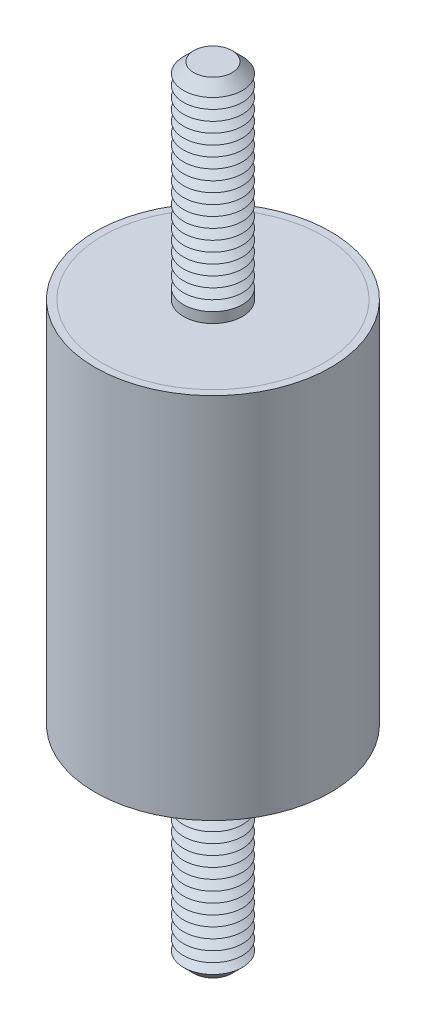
ISO-10303-21;
HEADER;
FILE_DESCRIPTION(('STEP AP214'),'2;1');
FILE_NAME('part.step','',(''),(''),'','','');
FILE_SCHEMA(('AUTOMOTIVE_DESIGN { 1 0 10303 214 1 1 1 1 }'));
ENDSEC;
DATA;
#1=APPLICATION_CONTEXT('core data for automotive mechanical design processes');
#2=APPLICATION_PROTOCOL_DEFINITION('international standard','automotive_design',2000,#1);
#3=PRODUCT_CONTEXT('',#1,'mechanical');
#4=PRODUCT('Part','Part','',(#3));
#5=PRODUCT_RELATED_PRODUCT_CATEGORY('part','',(#4));
#6=PRODUCT_DEFINITION_FORMATION('','',#4);
#7=PRODUCT_DEFINITION_CONTEXT('part definition',#1,'design');
#8=PRODUCT_DEFINITION('design','',#6,#7);
#9=PRODUCT_DEFINITION_SHAPE('','',#8);
#10=(LENGTH_UNIT() NAMED_UNIT(*) SI_UNIT(.MILLI.,.METRE.));
#11=(NAMED_UNIT(*) PLANE_ANGLE_UNIT() SI_UNIT($,.RADIAN.));
#12=(NAMED_UNIT(*) SI_UNIT($,.STERADIAN.) SOLID_ANGLE_UNIT());
#13=UNCERTAINTY_MEASURE_WITH_UNIT(LENGTH_MEASURE(1.E-05),#10,'distance_accuracy_value','');
#14=(GEOMETRIC_REPRESENTATION_CONTEXT(3) GLOBAL_UNCERTAINTY_ASSIGNED_CONTEXT((#13)) GLOBAL_UNIT_ASSIGNED_CONTEXT((#10,
#11,#12)) REPRESENTATION_CONTEXT('',''));
#15=CARTESIAN_POINT('',(0.,0.,0.));
#16=DIRECTION('',(0.,0.,1.));
#17=DIRECTION('',(1.,0.,0.));
#18=AXIS2_PLACEMENT_3D('',#15,#16,#17);
#19=CARTESIAN_POINT('',(0.,-26.5,0.));
#20=DIRECTION('',(0.,1.,0.));
#21=DIRECTION('',(0.,0.,1.));
#22=AXIS2_PLACEMENT_3D('',#19,#20,#21);
#23=CYLINDRICAL_SURFACE('',#22,2.);
#24=CARTESIAN_POINT('',(0.,-12.5,0.));
#25=DIRECTION('',(0.,-1.,0.));
#26=DIRECTION('',(0.,0.,-1.));
#27=AXIS2_PLACEMENT_3D('',#24,#25,#26);
#28=CIRCLE('',#27,2.);
#29=CARTESIAN_POINT('',(0.,-12.5,-2.));
#30=VERTEX_POINT('',#29);
#31=EDGE_CURVE('P0_E21',#30,#30,#28,.T.);
#32=ORIENTED_EDGE('',*,*,#31,.T.);
#33=EDGE_LOOP('',(#32));
#34=FACE_BOUND('',#33,.T.);
#35=CARTESIAN_POINT('',(0.,-13.2,0.));
#36=DIRECTION('',(0.,1.,0.));
#37=DIRECTION('',(0.,0.,1.));
#38=AXIS2_PLACEMENT_3D('',#35,#36,#37);
#39=CIRCLE('',#38,2.);
#40=CARTESIAN_POINT('',(0.,-13.2,2.));
#41=VERTEX_POINT('',#40);
#42=EDGE_CURVE('P0_E33',#41,#41,#39,.T.);
#43=ORIENTED_EDGE('',*,*,#42,.T.);
#44=EDGE_LOOP('',(#43));
#45=FACE_BOUND('',#44,.T.);
#46=ADVANCED_FACE('P0_F14',(#34,#45),#23,.T.);
#47=CARTESIAN_POINT('',(0.,-12.5,0.));
#48=DIRECTION('',(0.,1.,0.));
#49=DIRECTION('',(0.,0.,1.));
#50=AXIS2_PLACEMENT_3D('',#47,#48,#49);
#51=CYLINDRICAL_SURFACE('',#50,7.5);
#52=CARTESIAN_POINT('',(0.,-12.5,0.));
#53=DIRECTION('',(0.,1.,0.));
#54=DIRECTION('',(0.,0.,1.));
#55=AXIS2_PLACEMENT_3D('',#52,#53,#54);
#56=CIRCLE('',#55,7.5);
#57=CARTESIAN_POINT('',(0.,-12.5,7.5));
#58=VERTEX_POINT('',#57);
#59=EDGE_CURVE('P0_E25',#58,#58,#56,.T.);
#60=ORIENTED_EDGE('',*,*,#59,.T.);
#61=EDGE_LOOP('',(#60));
#62=FACE_BOUND('',#61,.T.);
#63=CARTESIAN_POINT('',(0.,-11.5,0.));
#64=DIRECTION('',(0.,1.,0.));
#65=DIRECTION('',(0.,0.,1.));
#66=AXIS2_PLACEMENT_3D('',#63,#64,#65);
#67=CIRCLE('',#66,7.5);
#68=CARTESIAN_POINT('',(0.,-11.5,7.5));
#69=VERTEX_POINT('',#68);
#70=EDGE_CURVE('P0_E30',#69,#69,#67,.T.);
#71=ORIENTED_EDGE('',*,*,#70,.F.);
#72=EDGE_LOOP('',(#71));
#73=FACE_BOUND('',#72,.T.);
#74=ADVANCED_FACE('P0_F169',(#62,#73),#51,.T.);
#75=CARTESIAN_POINT('',(0.,-12.5,0.));
#76=DIRECTION('',(0.,1.,0.));
#77=DIRECTION('',(0.,0.,1.));
#78=AXIS2_PLACEMENT_3D('',#75,#76,#77);
#79=PLANE('',#78);
#80=ORIENTED_EDGE('',*,*,#31,.F.);
#81=EDGE_LOOP('',(#80));
#82=FACE_BOUND('',#81,.T.);
#83=ORIENTED_EDGE('',*,*,#59,.F.);
#84=EDGE_LOOP('',(#83));
#85=FACE_BOUND('',#84,.T.);
#86=ADVANCED_FACE('P0_F174',(#82,#85),#79,.F.);
#87=CARTESIAN_POINT('',(0.,-11.5,0.));
#88=DIRECTION('',(0.,1.,0.));
#89=DIRECTION('',(0.,0.,1.));
#90=AXIS2_PLACEMENT_3D('',#87,#88,#89);
#91=PLANE('',#90);
#92=ORIENTED_EDGE('',*,*,#70,.T.);
#93=EDGE_LOOP('',(#92));
#94=FACE_BOUND('',#93,.T.);
#95=ADVANCED_FACE('P0_F180',(#94),#91,.T.);
#96=CARTESIAN_POINT('',(0.,-13.2,0.));
#97=DIRECTION('',(0.,1.,0.));
#98=DIRECTION('',(0.,0.,1.));
#99=AXIS2_PLACEMENT_3D('',#96,#97,#98);
#100=CONICAL_SURFACE('',#99,2.,1.0471975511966);
#101=CARTESIAN_POINT('',(0.,-13.55,0.));
#102=DIRECTION('',(0.,1.,0.));
#103=DIRECTION('',(0.,0.,1.));
#104=AXIS2_PLACEMENT_3D('',#101,#102,#103);
#105=CIRCLE('',#104,1.39378221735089);
#106=CARTESIAN_POINT('',(0.,-13.55,1.39378221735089));
#107=VERTEX_POINT('',#106);
#108=EDGE_CURVE('P0_E39',#107,#107,#105,.T.);
#109=ORIENTED_EDGE('',*,*,#108,.T.);
#110=EDGE_LOOP('',(#109));
#111=FACE_BOUND('',#110,.T.);
#112=ORIENTED_EDGE('',*,*,#42,.F.);
#113=EDGE_LOOP('',(#112));
#114=FACE_BOUND('',#113,.T.);
#115=ADVANCED_FACE('P0_F183',(#111,#114),#100,.T.);
#116=CARTESIAN_POINT('',(0.,-13.55,0.));
#117=DIRECTION('',(0.,-1.,0.));
#118=DIRECTION('',(0.,0.,-1.));
#119=AXIS2_PLACEMENT_3D('',#116,#117,#118);
#120=CONICAL_SURFACE('',#119,1.39378221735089,1.0471975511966);
#121=CARTESIAN_POINT('',(0.,-13.9,0.));
#122=DIRECTION('',(0.,1.,0.));
#123=DIRECTION('',(0.,0.,1.));
#124=AXIS2_PLACEMENT_3D('',#121,#122,#123);
#125=CIRCLE('',#124,2.);
#126=CARTESIAN_POINT('',(0.,-13.9,2.));
#127=VERTEX_POINT('',#126);
#128=EDGE_CURVE('P0_E43',#127,#127,#125,.T.);
#129=ORIENTED_EDGE('',*,*,#128,.T.);
#130=EDGE_LOOP('',(#129));
#131=FACE_BOUND('',#130,.T.);
#132=ORIENTED_EDGE('',*,*,#108,.F.);
#133=EDGE_LOOP('',(#132));
#134=FACE_BOUND('',#133,.T.);
#135=ADVANCED_FACE('P0_F187',(#131,#134),#120,.T.);
#136=CARTESIAN_POINT('',(0.,-13.9,0.));
#137=DIRECTION('',(0.,1.,0.));
#138=DIRECTION('',(0.,0.,1.));
#139=AXIS2_PLACEMENT_3D('',#136,#137,#138);
#140=CONICAL_SURFACE('',#139,2.,1.0471975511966);
#141=CARTESIAN_POINT('',(0.,-14.25,0.));
#142=DIRECTION('',(0.,1.,0.));
#143=DIRECTION('',(0.,0.,1.));
#144=AXIS2_PLACEMENT_3D('',#141,#142,#143);
#145=CIRCLE('',#144,1.39378221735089);
#146=CARTESIAN_POINT('',(0.,-14.25,1.39378221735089));
#147=VERTEX_POINT('',#146);
#148=EDGE_CURVE('P0_E47',#147,#147,#145,.T.);
#149=ORIENTED_EDGE('',*,*,#148,.T.);
#150=EDGE_LOOP('',(#149));
#151=FACE_BOUND('',#150,.T.);
#152=ORIENTED_EDGE('',*,*,#128,.F.);
#153=EDGE_LOOP('',(#152));
#154=FACE_BOUND('',#153,.T.);
#155=ADVANCED_FACE('P0_F191',(#151,#154),#140,.T.);
#156=CARTESIAN_POINT('',(0.,-14.25,0.));
#157=DIRECTION('',(0.,-1.,0.));
#158=DIRECTION('',(0.,0.,-1.));
#159=AXIS2_PLACEMENT_3D('',#156,#157,#158);
#160=CONICAL_SURFACE('',#159,1.39378221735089,1.0471975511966);
#161=CARTESIAN_POINT('',(0.,-14.6,0.));
#162=DIRECTION('',(0.,1.,0.));
#163=DIRECTION('',(0.,0.,1.));
#164=AXIS2_PLACEMENT_3D('',#161,#162,#163);
#165=CIRCLE('',#164,2.);
#166=CARTESIAN_POINT('',(0.,-14.6,2.));
#167=VERTEX_POINT('',#166);
#168=EDGE_CURVE('P0_E52',#167,#167,#165,.T.);
#169=ORIENTED_EDGE('',*,*,#168,.T.);
#170=EDGE_LOOP('',(#169));
#171=FACE_BOUND('',#170,.T.);
#172=ORIENTED_EDGE('',*,*,#148,.F.);
#173=EDGE_LOOP('',(#172));
#174=FACE_BOUND('',#173,.T.);
#175=ADVANCED_FACE('P0_F198',(#171,#174),#160,.T.);
#176=CARTESIAN_POINT('',(0.,-14.6,0.));
#177=DIRECTION('',(0.,1.,0.));
#178=DIRECTION('',(0.,0.,1.));
#179=AXIS2_PLACEMENT_3D('',#176,#177,#178);
#180=CONICAL_SURFACE('',#179,2.,1.0471975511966);
#181=CARTESIAN_POINT('',(0.,-14.95,0.));
#182=DIRECTION('',(0.,1.,0.));
#183=DIRECTION('',(0.,0.,1.));
#184=AXIS2_PLACEMENT_3D('',#181,#182,#183);
#185=CIRCLE('',#184,1.39378221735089);
#186=CARTESIAN_POINT('',(0.,-14.95,1.39378221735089));
#187=VERTEX_POINT('',#186);
#188=EDGE_CURVE('P0_E55',#187,#187,#185,.T.);
#189=ORIENTED_EDGE('',*,*,#188,.T.);
#190=EDGE_LOOP('',(#189));
#191=FACE_BOUND('',#190,.T.);
#192=ORIENTED_EDGE('',*,*,#168,.F.);
#193=EDGE_LOOP('',(#192));
#194=FACE_BOUND('',#193,.T.);
#195=ADVANCED_FACE('P0_F202',(#191,#194),#180,.T.);
#196=CARTESIAN_POINT('',(0.,-14.95,0.));
#197=DIRECTION('',(0.,-1.,0.));
#198=DIRECTION('',(0.,0.,-1.));
#199=AXIS2_PLACEMENT_3D('',#196,#197,#198);
#200=CONICAL_SURFACE('',#199,1.39378221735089,1.0471975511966);
#201=CARTESIAN_POINT('',(0.,-15.3,0.));
#202=DIRECTION('',(0.,1.,0.));
#203=DIRECTION('',(0.,0.,1.));
#204=AXIS2_PLACEMENT_3D('',#201,#202,#203);
#205=CIRCLE('',#204,2.);
#206=CARTESIAN_POINT('',(0.,-15.3,2.));
#207=VERTEX_POINT('',#206);
#208=EDGE_CURVE('P0_E58',#207,#207,#205,.T.);
#209=ORIENTED_EDGE('',*,*,#208,.T.);
#210=EDGE_LOOP('',(#209));
#211=FACE_BOUND('',#210,.T.);
#212=ORIENTED_EDGE('',*,*,#188,.F.);
#213=EDGE_LOOP('',(#212));
#214=FACE_BOUND('',#213,.T.);
#215=ADVANCED_FACE('P0_F206',(#211,#214),#200,.T.);
#216=CARTESIAN_POINT('',(0.,-15.3,0.));
#217=DIRECTION('',(0.,1.,0.));
#218=DIRECTION('',(0.,0.,1.));
#219=AXIS2_PLACEMENT_3D('',#216,#217,#218);
#220=CONICAL_SURFACE('',#219,2.,1.0471975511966);
#221=CARTESIAN_POINT('',(0.,-15.65,0.));
#222=DIRECTION('',(0.,1.,0.));
#223=DIRECTION('',(0.,0.,1.));
#224=AXIS2_PLACEMENT_3D('',#221,#222,#223);
#225=CIRCLE('',#224,1.39378221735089);
#226=CARTESIAN_POINT('',(0.,-15.65,1.39378221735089));
#227=VERTEX_POINT('',#226);
#228=EDGE_CURVE('P0_E61',#227,#227,#225,.T.);
#229=ORIENTED_EDGE('',*,*,#228,.T.);
#230=EDGE_LOOP('',(#229));
#231=FACE_BOUND('',#230,.T.);
#232=ORIENTED_EDGE('',*,*,#208,.F.);
#233=EDGE_LOOP('',(#232));
#234=FACE_BOUND('',#233,.T.);
#235=ADVANCED_FACE('P0_F210',(#231,#234),#220,.T.);
#236=CARTESIAN_POINT('',(0.,-15.65,0.));
#237=DIRECTION('',(0.,-1.,0.));
#238=DIRECTION('',(0.,0.,-1.));
#239=AXIS2_PLACEMENT_3D('',#236,#237,#238);
#240=CONICAL_SURFACE('',#239,1.39378221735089,1.0471975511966);
#241=CARTESIAN_POINT('',(0.,-16.,0.));
#242=DIRECTION('',(0.,1.,0.));
#243=DIRECTION('',(0.,0.,1.));
#244=AXIS2_PLACEMENT_3D('',#241,#242,#243);
#245=CIRCLE('',#244,2.);
#246=CARTESIAN_POINT('',(0.,-16.,2.));
#247=VERTEX_POINT('',#246);
#248=EDGE_CURVE('P0_E64',#247,#247,#245,.T.);
#249=ORIENTED_EDGE('',*,*,#248,.T.);
#250=EDGE_LOOP('',(#249));
#251=FACE_BOUND('',#250,.T.);
#252=ORIENTED_EDGE('',*,*,#228,.F.);
#253=EDGE_LOOP('',(#252));
#254=FACE_BOUND('',#253,.T.);
#255=ADVANCED_FACE('P0_F214',(#251,#254),#240,.T.);
#256=CARTESIAN_POINT('',(0.,-16.,0.));
#257=DIRECTION('',(0.,1.,0.));
#258=DIRECTION('',(0.,0.,1.));
#259=AXIS2_PLACEMENT_3D('',#256,#257,#258);
#260=CONICAL_SURFACE('',#259,2.,1.0471975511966);
#261=CARTESIAN_POINT('',(0.,-16.35,0.));
#262=DIRECTION('',(0.,1.,0.));
#263=DIRECTION('',(0.,0.,1.));
#264=AXIS2_PLACEMENT_3D('',#261,#262,#263);
#265=CIRCLE('',#264,1.39378221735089);
#266=CARTESIAN_POINT('',(0.,-16.35,1.39378221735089));
#267=VERTEX_POINT('',#266);
#268=EDGE_CURVE('P0_E67',#267,#267,#265,.T.);
#269=ORIENTED_EDGE('',*,*,#268,.T.);
#270=EDGE_LOOP('',(#269));
#271=FACE_BOUND('',#270,.T.);
#272=ORIENTED_EDGE('',*,*,#248,.F.);
#273=EDGE_LOOP('',(#272));
#274=FACE_BOUND('',#273,.T.);
#275=ADVANCED_FACE('P0_F218',(#271,#274),#260,.T.);
#276=CARTESIAN_POINT('',(0.,-16.35,0.));
#277=DIRECTION('',(0.,-1.,0.));
#278=DIRECTION('',(0.,0.,-1.));
#279=AXIS2_PLACEMENT_3D('',#276,#277,#278);
#280=CONICAL_SURFACE('',#279,1.39378221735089,1.0471975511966);
#281=CARTESIAN_POINT('',(0.,-16.7,0.));
#282=DIRECTION('',(0.,1.,0.));
#283=DIRECTION('',(0.,0.,1.));
#284=AXIS2_PLACEMENT_3D('',#281,#282,#283);
#285=CIRCLE('',#284,2.);
#286=CARTESIAN_POINT('',(0.,-16.7,2.));
#287=VERTEX_POINT('',#286);
#288=EDGE_CURVE('P0_E70',#287,#287,#285,.T.);
#289=ORIENTED_EDGE('',*,*,#288,.T.);
#290=EDGE_LOOP('',(#289));
#291=FACE_BOUND('',#290,.T.);
#292=ORIENTED_EDGE('',*,*,#268,.F.);
#293=EDGE_LOOP('',(#292));
#294=FACE_BOUND('',#293,.T.);
#295=ADVANCED_FACE('P0_F222',(#291,#294),#280,.T.);
#296=CARTESIAN_POINT('',(0.,-16.7,0.));
#297=DIRECTION('',(0.,1.,0.));
#298=DIRECTION('',(0.,0.,1.));
#299=AXIS2_PLACEMENT_3D('',#296,#297,#298);
#300=CONICAL_SURFACE('',#299,2.,1.0471975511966);
#301=CARTESIAN_POINT('',(0.,-17.05,0.));
#302=DIRECTION('',(0.,1.,0.));
#303=DIRECTION('',(0.,0.,1.));
#304=AXIS2_PLACEMENT_3D('',#301,#302,#303);
#305=CIRCLE('',#304,1.39378221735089);
#306=CARTESIAN_POINT('',(0.,-17.05,1.39378221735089));
#307=VERTEX_POINT('',#306);
#308=EDGE_CURVE('P0_E73',#307,#307,#305,.T.);
#309=ORIENTED_EDGE('',*,*,#308,.T.);
#310=EDGE_LOOP('',(#309));
#311=FACE_BOUND('',#310,.T.);
#312=ORIENTED_EDGE('',*,*,#288,.F.);
#313=EDGE_LOOP('',(#312));
#314=FACE_BOUND('',#313,.T.);
#315=ADVANCED_FACE('P0_F226',(#311,#314),#300,.T.);
#316=CARTESIAN_POINT('',(0.,-17.05,0.));
#317=DIRECTION('',(0.,-1.,0.));
#318=DIRECTION('',(0.,0.,-1.));
#319=AXIS2_PLACEMENT_3D('',#316,#317,#318);
#320=CONICAL_SURFACE('',#319,1.39378221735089,1.0471975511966);
#321=CARTESIAN_POINT('',(0.,-17.4,0.));
#322=DIRECTION('',(0.,1.,0.));
#323=DIRECTION('',(0.,0.,1.));
#324=AXIS2_PLACEMENT_3D('',#321,#322,#323);
#325=CIRCLE('',#324,2.);
#326=CARTESIAN_POINT('',(0.,-17.4,2.));
#327=VERTEX_POINT('',#326);
#328=EDGE_CURVE('P0_E76',#327,#327,#325,.T.);
#329=ORIENTED_EDGE('',*,*,#328,.T.);
#330=EDGE_LOOP('',(#329));
#331=FACE_BOUND('',#330,.T.);
#332=ORIENTED_EDGE('',*,*,#308,.F.);
#333=EDGE_LOOP('',(#332));
#334=FACE_BOUND('',#333,.T.);
#335=ADVANCED_FACE('P0_F230',(#331,#334),#320,.T.);
#336=CARTESIAN_POINT('',(0.,-17.4,0.));
#337=DIRECTION('',(0.,1.,0.));
#338=DIRECTION('',(0.,0.,1.));
#339=AXIS2_PLACEMENT_3D('',#336,#337,#338);
#340=CONICAL_SURFACE('',#339,2.,1.0471975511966);
#341=CARTESIAN_POINT('',(0.,-17.75,0.));
#342=DIRECTION('',(0.,1.,0.));
#343=DIRECTION('',(0.,0.,1.));
#344=AXIS2_PLACEMENT_3D('',#341,#342,#343);
#345=CIRCLE('',#344,1.39378221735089);
#346=CARTESIAN_POINT('',(0.,-17.75,1.39378221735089));
#347=VERTEX_POINT('',#346);
#348=EDGE_CURVE('P0_E79',#347,#347,#345,.T.);
#349=ORIENTED_EDGE('',*,*,#348,.T.);
#350=EDGE_LOOP('',(#349));
#351=FACE_BOUND('',#350,.T.);
#352=ORIENTED_EDGE('',*,*,#328,.F.);
#353=EDGE_LOOP('',(#352));
#354=FACE_BOUND('',#353,.T.);
#355=ADVANCED_FACE('P0_F234',(#351,#354),#340,.T.);
#356=CARTESIAN_POINT('',(0.,-17.75,0.));
#357=DIRECTION('',(0.,-1.,0.));
#358=DIRECTION('',(0.,0.,-1.));
#359=AXIS2_PLACEMENT_3D('',#356,#357,#358);
#360=CONICAL_SURFACE('',#359,1.39378221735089,1.0471975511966);
#361=CARTESIAN_POINT('',(0.,-18.1,0.));
#362=DIRECTION('',(0.,1.,0.));
#363=DIRECTION('',(0.,0.,1.));
#364=AXIS2_PLACEMENT_3D('',#361,#362,#363);
#365=CIRCLE('',#364,2.);
#366=CARTESIAN_POINT('',(0.,-18.1,2.));
#367=VERTEX_POINT('',#366);
#368=EDGE_CURVE('P0_E82',#367,#367,#365,.T.);
#369=ORIENTED_EDGE('',*,*,#368,.T.);
#370=EDGE_LOOP('',(#369));
#371=FACE_BOUND('',#370,.T.);
#372=ORIENTED_EDGE('',*,*,#348,.F.);
#373=EDGE_LOOP('',(#372));
#374=FACE_BOUND('',#373,.T.);
#375=ADVANCED_FACE('P0_F238',(#371,#374),#360,.T.);
#376=CARTESIAN_POINT('',(0.,-18.1,0.));
#377=DIRECTION('',(0.,1.,0.));
#378=DIRECTION('',(0.,0.,1.));
#379=AXIS2_PLACEMENT_3D('',#376,#377,#378);
#380=CONICAL_SURFACE('',#379,2.,1.0471975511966);
#381=CARTESIAN_POINT('',(0.,-18.45,0.));
#382=DIRECTION('',(0.,1.,0.));
#383=DIRECTION('',(0.,0.,1.));
#384=AXIS2_PLACEMENT_3D('',#381,#382,#383);
#385=CIRCLE('',#384,1.39378221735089);
#386=CARTESIAN_POINT('',(0.,-18.45,1.39378221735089));
#387=VERTEX_POINT('',#386);
#388=EDGE_CURVE('P0_E85',#387,#387,#385,.T.);
#389=ORIENTED_EDGE('',*,*,#388,.T.);
#390=EDGE_LOOP('',(#389));
#391=FACE_BOUND('',#390,.T.);
#392=ORIENTED_EDGE('',*,*,#368,.F.);
#393=EDGE_LOOP('',(#392));
#394=FACE_BOUND('',#393,.T.);
#395=ADVANCED_FACE('P0_F242',(#391,#394),#380,.T.);
#396=CARTESIAN_POINT('',(0.,-18.45,0.));
#397=DIRECTION('',(0.,-1.,0.));
#398=DIRECTION('',(0.,0.,-1.));
#399=AXIS2_PLACEMENT_3D('',#396,#397,#398);
#400=CONICAL_SURFACE('',#399,1.39378221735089,1.0471975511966);
#401=CARTESIAN_POINT('',(0.,-18.8,0.));
#402=DIRECTION('',(0.,1.,0.));
#403=DIRECTION('',(0.,0.,1.));
#404=AXIS2_PLACEMENT_3D('',#401,#402,#403);
#405=CIRCLE('',#404,2.);
#406=CARTESIAN_POINT('',(0.,-18.8,2.));
#407=VERTEX_POINT('',#406);
#408=EDGE_CURVE('P0_E88',#407,#407,#405,.T.);
#409=ORIENTED_EDGE('',*,*,#408,.T.);
#410=EDGE_LOOP('',(#409));
#411=FACE_BOUND('',#410,.T.);
#412=ORIENTED_EDGE('',*,*,#388,.F.);
#413=EDGE_LOOP('',(#412));
#414=FACE_BOUND('',#413,.T.);
#415=ADVANCED_FACE('P0_F246',(#411,#414),#400,.T.);
#416=CARTESIAN_POINT('',(0.,-18.8,0.));
#417=DIRECTION('',(0.,1.,0.));
#418=DIRECTION('',(0.,0.,1.));
#419=AXIS2_PLACEMENT_3D('',#416,#417,#418);
#420=CONICAL_SURFACE('',#419,2.,1.0471975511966);
#421=CARTESIAN_POINT('',(0.,-19.15,0.));
#422=DIRECTION('',(0.,1.,0.));
#423=DIRECTION('',(0.,0.,1.));
#424=AXIS2_PLACEMENT_3D('',#421,#422,#423);
#425=CIRCLE('',#424,1.39378221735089);
#426=CARTESIAN_POINT('',(0.,-19.15,1.39378221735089));
#427=VERTEX_POINT('',#426);
#428=EDGE_CURVE('P0_E91',#427,#427,#425,.T.);
#429=ORIENTED_EDGE('',*,*,#428,.T.);
#430=EDGE_LOOP('',(#429));
#431=FACE_BOUND('',#430,.T.);
#432=ORIENTED_EDGE('',*,*,#408,.F.);
#433=EDGE_LOOP('',(#432));
#434=FACE_BOUND('',#433,.T.);
#435=ADVANCED_FACE('P0_F250',(#431,#434),#420,.T.);
#436=CARTESIAN_POINT('',(0.,-19.15,0.));
#437=DIRECTION('',(0.,-1.,0.));
#438=DIRECTION('',(0.,0.,-1.));
#439=AXIS2_PLACEMENT_3D('',#436,#437,#438);
#440=CONICAL_SURFACE('',#439,1.39378221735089,1.0471975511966);
#441=CARTESIAN_POINT('',(0.,-19.5,0.));
#442=DIRECTION('',(0.,1.,0.));
#443=DIRECTION('',(0.,0.,1.));
#444=AXIS2_PLACEMENT_3D('',#441,#442,#443);
#445=CIRCLE('',#444,2.);
#446=CARTESIAN_POINT('',(0.,-19.5,2.));
#447=VERTEX_POINT('',#446);
#448=EDGE_CURVE('P0_E94',#447,#447,#445,.T.);
#449=ORIENTED_EDGE('',*,*,#448,.T.);
#450=EDGE_LOOP('',(#449));
#451=FACE_BOUND('',#450,.T.);
#452=ORIENTED_EDGE('',*,*,#428,.F.);
#453=EDGE_LOOP('',(#452));
#454=FACE_BOUND('',#453,.T.);
#455=ADVANCED_FACE('P0_F254',(#451,#454),#440,.T.);
#456=CARTESIAN_POINT('',(0.,-19.5,0.));
#457=DIRECTION('',(0.,1.,0.));
#458=DIRECTION('',(0.,0.,1.));
#459=AXIS2_PLACEMENT_3D('',#456,#457,#458);
#460=CONICAL_SURFACE('',#459,2.,1.0471975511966);
#461=CARTESIAN_POINT('',(0.,-19.85,0.));
#462=DIRECTION('',(0.,1.,0.));
#463=DIRECTION('',(0.,0.,1.));
#464=AXIS2_PLACEMENT_3D('',#461,#462,#463);
#465=CIRCLE('',#464,1.39378221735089);
#466=CARTESIAN_POINT('',(0.,-19.85,1.39378221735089));
#467=VERTEX_POINT('',#466);
#468=EDGE_CURVE('P0_E97',#467,#467,#465,.T.);
#469=ORIENTED_EDGE('',*,*,#468,.T.);
#470=EDGE_LOOP('',(#469));
#471=FACE_BOUND('',#470,.T.);
#472=ORIENTED_EDGE('',*,*,#448,.F.);
#473=EDGE_LOOP('',(#472));
#474=FACE_BOUND('',#473,.T.);
#475=ADVANCED_FACE('P0_F258',(#471,#474),#460,.T.);
#476=CARTESIAN_POINT('',(0.,-19.85,0.));
#477=DIRECTION('',(0.,-1.,0.));
#478=DIRECTION('',(0.,0.,-1.));
#479=AXIS2_PLACEMENT_3D('',#476,#477,#478);
#480=CONICAL_SURFACE('',#479,1.39378221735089,1.0471975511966);
#481=CARTESIAN_POINT('',(0.,-20.2,0.));
#482=DIRECTION('',(0.,1.,0.));
#483=DIRECTION('',(0.,0.,1.));
#484=AXIS2_PLACEMENT_3D('',#481,#482,#483);
#485=CIRCLE('',#484,2.);
#486=CARTESIAN_POINT('',(0.,-20.2,2.));
#487=VERTEX_POINT('',#486);
#488=EDGE_CURVE('P0_E100',#487,#487,#485,.T.);
#489=ORIENTED_EDGE('',*,*,#488,.T.);
#490=EDGE_LOOP('',(#489));
#491=FACE_BOUND('',#490,.T.);
#492=ORIENTED_EDGE('',*,*,#468,.F.);
#493=EDGE_LOOP('',(#492));
#494=FACE_BOUND('',#493,.T.);
#495=ADVANCED_FACE('P0_F262',(#491,#494),#480,.T.);
#496=CARTESIAN_POINT('',(0.,-20.2,0.));
#497=DIRECTION('',(0.,1.,0.));
#498=DIRECTION('',(0.,0.,1.));
#499=AXIS2_PLACEMENT_3D('',#496,#497,#498);
#500=CONICAL_SURFACE('',#499,2.,1.0471975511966);
#501=CARTESIAN_POINT('',(0.,-20.55,0.));
#502=DIRECTION('',(0.,1.,0.));
#503=DIRECTION('',(0.,0.,1.));
#504=AXIS2_PLACEMENT_3D('',#501,#502,#503);
#505=CIRCLE('',#504,1.39378221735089);
#506=CARTESIAN_POINT('',(0.,-20.55,1.39378221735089));
#507=VERTEX_POINT('',#506);
#508=EDGE_CURVE('P0_E103',#507,#507,#505,.T.);
#509=ORIENTED_EDGE('',*,*,#508,.T.);
#510=EDGE_LOOP('',(#509));
#511=FACE_BOUND('',#510,.T.);
#512=ORIENTED_EDGE('',*,*,#488,.F.);
#513=EDGE_LOOP('',(#512));
#514=FACE_BOUND('',#513,.T.);
#515=ADVANCED_FACE('P0_F266',(#511,#514),#500,.T.);
#516=CARTESIAN_POINT('',(0.,-20.55,0.));
#517=DIRECTION('',(0.,-1.,0.));
#518=DIRECTION('',(0.,0.,-1.));
#519=AXIS2_PLACEMENT_3D('',#516,#517,#518);
#520=CONICAL_SURFACE('',#519,1.39378221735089,1.0471975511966);
#521=CARTESIAN_POINT('',(0.,-20.9,0.));
#522=DIRECTION('',(0.,1.,0.));
#523=DIRECTION('',(0.,0.,1.));
#524=AXIS2_PLACEMENT_3D('',#521,#522,#523);
#525=CIRCLE('',#524,2.);
#526=CARTESIAN_POINT('',(0.,-20.9,2.));
#527=VERTEX_POINT('',#526);
#528=EDGE_CURVE('P0_E106',#527,#527,#525,.T.);
#529=ORIENTED_EDGE('',*,*,#528,.T.);
#530=EDGE_LOOP('',(#529));
#531=FACE_BOUND('',#530,.T.);
#532=ORIENTED_EDGE('',*,*,#508,.F.);
#533=EDGE_LOOP('',(#532));
#534=FACE_BOUND('',#533,.T.);
#535=ADVANCED_FACE('P0_F270',(#531,#534),#520,.T.);
#536=CARTESIAN_POINT('',(0.,-20.9,0.));
#537=DIRECTION('',(0.,1.,0.));
#538=DIRECTION('',(0.,0.,1.));
#539=AXIS2_PLACEMENT_3D('',#536,#537,#538);
#540=CONICAL_SURFACE('',#539,2.,1.0471975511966);
#541=CARTESIAN_POINT('',(0.,-21.25,0.));
#542=DIRECTION('',(0.,1.,0.));
#543=DIRECTION('',(0.,0.,1.));
#544=AXIS2_PLACEMENT_3D('',#541,#542,#543);
#545=CIRCLE('',#544,1.39378221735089);
#546=CARTESIAN_POINT('',(0.,-21.25,1.39378221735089));
#547=VERTEX_POINT('',#546);
#548=EDGE_CURVE('P0_E109',#547,#547,#545,.T.);
#549=ORIENTED_EDGE('',*,*,#548,.T.);
#550=EDGE_LOOP('',(#549));
#551=FACE_BOUND('',#550,.T.);
#552=ORIENTED_EDGE('',*,*,#528,.F.);
#553=EDGE_LOOP('',(#552));
#554=FACE_BOUND('',#553,.T.);
#555=ADVANCED_FACE('P0_F274',(#551,#554),#540,.T.);
#556=CARTESIAN_POINT('',(0.,-21.25,0.));
#557=DIRECTION('',(0.,-1.,0.));
#558=DIRECTION('',(0.,0.,-1.));
#559=AXIS2_PLACEMENT_3D('',#556,#557,#558);
#560=CONICAL_SURFACE('',#559,1.39378221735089,1.0471975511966);
#561=CARTESIAN_POINT('',(0.,-21.6,0.));
#562=DIRECTION('',(0.,1.,0.));
#563=DIRECTION('',(0.,0.,1.));
#564=AXIS2_PLACEMENT_3D('',#561,#562,#563);
#565=CIRCLE('',#564,2.);
#566=CARTESIAN_POINT('',(0.,-21.6,2.));
#567=VERTEX_POINT('',#566);
#568=EDGE_CURVE('P0_E112',#567,#567,#565,.T.);
#569=ORIENTED_EDGE('',*,*,#568,.T.);
#570=EDGE_LOOP('',(#569));
#571=FACE_BOUND('',#570,.T.);
#572=ORIENTED_EDGE('',*,*,#548,.F.);
#573=EDGE_LOOP('',(#572));
#574=FACE_BOUND('',#573,.T.);
#575=ADVANCED_FACE('P0_F278',(#571,#574),#560,.T.);
#576=CARTESIAN_POINT('',(0.,-21.6,0.));
#577=DIRECTION('',(0.,1.,0.));
#578=DIRECTION('',(0.,0.,1.));
#579=AXIS2_PLACEMENT_3D('',#576,#577,#578);
#580=CONICAL_SURFACE('',#579,2.,1.0471975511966);
#581=CARTESIAN_POINT('',(0.,-21.95,0.));
#582=DIRECTION('',(0.,1.,0.));
#583=DIRECTION('',(0.,0.,1.));
#584=AXIS2_PLACEMENT_3D('',#581,#582,#583);
#585=CIRCLE('',#584,1.39378221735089);
#586=CARTESIAN_POINT('',(0.,-21.95,1.39378221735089));
#587=VERTEX_POINT('',#586);
#588=EDGE_CURVE('P0_E115',#587,#587,#585,.T.);
#589=ORIENTED_EDGE('',*,*,#588,.T.);
#590=EDGE_LOOP('',(#589));
#591=FACE_BOUND('',#590,.T.);
#592=ORIENTED_EDGE('',*,*,#568,.F.);
#593=EDGE_LOOP('',(#592));
#594=FACE_BOUND('',#593,.T.);
#595=ADVANCED_FACE('P0_F282',(#591,#594),#580,.T.);
#596=CARTESIAN_POINT('',(0.,-21.95,0.));
#597=DIRECTION('',(0.,-1.,0.));
#598=DIRECTION('',(0.,0.,-1.));
#599=AXIS2_PLACEMENT_3D('',#596,#597,#598);
#600=CONICAL_SURFACE('',#599,1.39378221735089,1.0471975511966);
#601=CARTESIAN_POINT('',(0.,-22.3,0.));
#602=DIRECTION('',(0.,1.,0.));
#603=DIRECTION('',(0.,0.,1.));
#604=AXIS2_PLACEMENT_3D('',#601,#602,#603);
#605=CIRCLE('',#604,2.);
#606=CARTESIAN_POINT('',(0.,-22.3,2.));
#607=VERTEX_POINT('',#606);
#608=EDGE_CURVE('P0_E118',#607,#607,#605,.T.);
#609=ORIENTED_EDGE('',*,*,#608,.T.);
#610=EDGE_LOOP('',(#609));
#611=FACE_BOUND('',#610,.T.);
#612=ORIENTED_EDGE('',*,*,#588,.F.);
#613=EDGE_LOOP('',(#612));
#614=FACE_BOUND('',#613,.T.);
#615=ADVANCED_FACE('P0_F286',(#611,#614),#600,.T.);
#616=CARTESIAN_POINT('',(0.,-22.3,0.));
#617=DIRECTION('',(0.,1.,0.));
#618=DIRECTION('',(0.,0.,1.));
#619=AXIS2_PLACEMENT_3D('',#616,#617,#618);
#620=CONICAL_SURFACE('',#619,2.,1.0471975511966);
#621=CARTESIAN_POINT('',(0.,-22.65,0.));
#622=DIRECTION('',(0.,1.,0.));
#623=DIRECTION('',(0.,0.,1.));
#624=AXIS2_PLACEMENT_3D('',#621,#622,#623);
#625=CIRCLE('',#624,1.39378221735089);
#626=CARTESIAN_POINT('',(0.,-22.65,1.39378221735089));
#627=VERTEX_POINT('',#626);
#628=EDGE_CURVE('P0_E121',#627,#627,#625,.T.);
#629=ORIENTED_EDGE('',*,*,#628,.T.);
#630=EDGE_LOOP('',(#629));
#631=FACE_BOUND('',#630,.T.);
#632=ORIENTED_EDGE('',*,*,#608,.F.);
#633=EDGE_LOOP('',(#632));
#634=FACE_BOUND('',#633,.T.);
#635=ADVANCED_FACE('P0_F290',(#631,#634),#620,.T.);
#636=CARTESIAN_POINT('',(0.,-22.65,0.));
#637=DIRECTION('',(0.,-1.,0.));
#638=DIRECTION('',(0.,0.,-1.));
#639=AXIS2_PLACEMENT_3D('',#636,#637,#638);
#640=CONICAL_SURFACE('',#639,1.39378221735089,1.0471975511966);
#641=CARTESIAN_POINT('',(0.,-23.,0.));
#642=DIRECTION('',(0.,1.,0.));
#643=DIRECTION('',(0.,0.,1.));
#644=AXIS2_PLACEMENT_3D('',#641,#642,#643);
#645=CIRCLE('',#644,2.);
#646=CARTESIAN_POINT('',(0.,-23.,2.));
#647=VERTEX_POINT('',#646);
#648=EDGE_CURVE('P0_E124',#647,#647,#645,.T.);
#649=ORIENTED_EDGE('',*,*,#648,.T.);
#650=EDGE_LOOP('',(#649));
#651=FACE_BOUND('',#650,.T.);
#652=ORIENTED_EDGE('',*,*,#628,.F.);
#653=EDGE_LOOP('',(#652));
#654=FACE_BOUND('',#653,.T.);
#655=ADVANCED_FACE('P0_F294',(#651,#654),#640,.T.);
#656=CARTESIAN_POINT('',(0.,-23.,0.));
#657=DIRECTION('',(0.,1.,0.));
#658=DIRECTION('',(0.,0.,1.));
#659=AXIS2_PLACEMENT_3D('',#656,#657,#658);
#660=CONICAL_SURFACE('',#659,2.,1.0471975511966);
#661=CARTESIAN_POINT('',(0.,-23.35,0.));
#662=DIRECTION('',(0.,1.,0.));
#663=DIRECTION('',(0.,0.,1.));
#664=AXIS2_PLACEMENT_3D('',#661,#662,#663);
#665=CIRCLE('',#664,1.39378221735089);
#666=CARTESIAN_POINT('',(0.,-23.35,1.39378221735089));
#667=VERTEX_POINT('',#666);
#668=EDGE_CURVE('P0_E127',#667,#667,#665,.T.);
#669=ORIENTED_EDGE('',*,*,#668,.T.);
#670=EDGE_LOOP('',(#669));
#671=FACE_BOUND('',#670,.T.);
#672=ORIENTED_EDGE('',*,*,#648,.F.);
#673=EDGE_LOOP('',(#672));
#674=FACE_BOUND('',#673,.T.);
#675=ADVANCED_FACE('P0_F298',(#671,#674),#660,.T.);
#676=CARTESIAN_POINT('',(0.,-23.35,0.));
#677=DIRECTION('',(0.,-1.,0.));
#678=DIRECTION('',(0.,0.,-1.));
#679=AXIS2_PLACEMENT_3D('',#676,#677,#678);
#680=CONICAL_SURFACE('',#679,1.39378221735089,1.0471975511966);
#681=CARTESIAN_POINT('',(0.,-23.7,0.));
#682=DIRECTION('',(0.,1.,0.));
#683=DIRECTION('',(0.,0.,1.));
#684=AXIS2_PLACEMENT_3D('',#681,#682,#683);
#685=CIRCLE('',#684,2.);
#686=CARTESIAN_POINT('',(0.,-23.7,2.));
#687=VERTEX_POINT('',#686);
#688=EDGE_CURVE('P0_E130',#687,#687,#685,.T.);
#689=ORIENTED_EDGE('',*,*,#688,.T.);
#690=EDGE_LOOP('',(#689));
#691=FACE_BOUND('',#690,.T.);
#692=ORIENTED_EDGE('',*,*,#668,.F.);
#693=EDGE_LOOP('',(#692));
#694=FACE_BOUND('',#693,.T.);
#695=ADVANCED_FACE('P0_F302',(#691,#694),#680,.T.);
#696=CARTESIAN_POINT('',(0.,-23.7,0.));
#697=DIRECTION('',(0.,1.,0.));
#698=DIRECTION('',(0.,0.,1.));
#699=AXIS2_PLACEMENT_3D('',#696,#697,#698);
#700=CONICAL_SURFACE('',#699,2.,1.0471975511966);
#701=CARTESIAN_POINT('',(0.,-24.05,0.));
#702=DIRECTION('',(0.,1.,0.));
#703=DIRECTION('',(0.,0.,1.));
#704=AXIS2_PLACEMENT_3D('',#701,#702,#703);
#705=CIRCLE('',#704,1.39378221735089);
#706=CARTESIAN_POINT('',(0.,-24.05,1.39378221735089));
#707=VERTEX_POINT('',#706);
#708=EDGE_CURVE('P0_E133',#707,#707,#705,.T.);
#709=ORIENTED_EDGE('',*,*,#708,.T.);
#710=EDGE_LOOP('',(#709));
#711=FACE_BOUND('',#710,.T.);
#712=ORIENTED_EDGE('',*,*,#688,.F.);
#713=EDGE_LOOP('',(#712));
#714=FACE_BOUND('',#713,.T.);
#715=ADVANCED_FACE('P0_F306',(#711,#714),#700,.T.);
#716=CARTESIAN_POINT('',(0.,-24.05,0.));
#717=DIRECTION('',(0.,-1.,0.));
#718=DIRECTION('',(0.,0.,-1.));
#719=AXIS2_PLACEMENT_3D('',#716,#717,#718);
#720=CONICAL_SURFACE('',#719,1.39378221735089,1.0471975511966);
#721=CARTESIAN_POINT('',(0.,-24.4,0.));
#722=DIRECTION('',(0.,1.,0.));
#723=DIRECTION('',(0.,0.,1.));
#724=AXIS2_PLACEMENT_3D('',#721,#722,#723);
#725=CIRCLE('',#724,2.);
#726=CARTESIAN_POINT('',(0.,-24.4,2.));
#727=VERTEX_POINT('',#726);
#728=EDGE_CURVE('P0_E136',#727,#727,#725,.T.);
#729=ORIENTED_EDGE('',*,*,#728,.T.);
#730=EDGE_LOOP('',(#729));
#731=FACE_BOUND('',#730,.T.);
#732=ORIENTED_EDGE('',*,*,#708,.F.);
#733=EDGE_LOOP('',(#732));
#734=FACE_BOUND('',#733,.T.);
#735=ADVANCED_FACE('P0_F310',(#731,#734),#720,.T.);
#736=CARTESIAN_POINT('',(0.,-24.4,0.));
#737=DIRECTION('',(0.,1.,0.));
#738=DIRECTION('',(0.,0.,1.));
#739=AXIS2_PLACEMENT_3D('',#736,#737,#738);
#740=CONICAL_SURFACE('',#739,2.,1.0471975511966);
#741=CARTESIAN_POINT('',(0.,-24.75,0.));
#742=DIRECTION('',(0.,1.,0.));
#743=DIRECTION('',(0.,0.,1.));
#744=AXIS2_PLACEMENT_3D('',#741,#742,#743);
#745=CIRCLE('',#744,1.39378221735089);
#746=CARTESIAN_POINT('',(0.,-24.75,1.39378221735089));
#747=VERTEX_POINT('',#746);
#748=EDGE_CURVE('P0_E139',#747,#747,#745,.T.);
#749=ORIENTED_EDGE('',*,*,#748,.T.);
#750=EDGE_LOOP('',(#749));
#751=FACE_BOUND('',#750,.T.);
#752=ORIENTED_EDGE('',*,*,#728,.F.);
#753=EDGE_LOOP('',(#752));
#754=FACE_BOUND('',#753,.T.);
#755=ADVANCED_FACE('P0_F314',(#751,#754),#740,.T.);
#756=CARTESIAN_POINT('',(0.,-24.75,0.));
#757=DIRECTION('',(0.,-1.,0.));
#758=DIRECTION('',(0.,0.,-1.));
#759=AXIS2_PLACEMENT_3D('',#756,#757,#758);
#760=CONICAL_SURFACE('',#759,1.39378221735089,1.0471975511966);
#761=CARTESIAN_POINT('',(0.,-25.1,0.));
#762=DIRECTION('',(0.,1.,0.));
#763=DIRECTION('',(0.,0.,1.));
#764=AXIS2_PLACEMENT_3D('',#761,#762,#763);
#765=CIRCLE('',#764,2.);
#766=CARTESIAN_POINT('',(0.,-25.1,2.));
#767=VERTEX_POINT('',#766);
#768=EDGE_CURVE('P0_E142',#767,#767,#765,.T.);
#769=ORIENTED_EDGE('',*,*,#768,.T.);
#770=EDGE_LOOP('',(#769));
#771=FACE_BOUND('',#770,.T.);
#772=ORIENTED_EDGE('',*,*,#748,.F.);
#773=EDGE_LOOP('',(#772));
#774=FACE_BOUND('',#773,.T.);
#775=ADVANCED_FACE('P0_F166',(#771,#774),#760,.T.);
#776=CARTESIAN_POINT('',(0.,-25.1,0.));
#777=DIRECTION('',(0.,1.,0.));
#778=DIRECTION('',(0.,0.,1.));
#779=AXIS2_PLACEMENT_3D('',#776,#777,#778);
#780=CONICAL_SURFACE('',#779,2.,1.0471975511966);
#781=CARTESIAN_POINT('',(0.,-25.45,0.));
#782=DIRECTION('',(0.,1.,0.));
#783=DIRECTION('',(0.,0.,1.));
#784=AXIS2_PLACEMENT_3D('',#781,#782,#783);
#785=CIRCLE('',#784,1.39378221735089);
#786=CARTESIAN_POINT('',(0.,-25.45,1.39378221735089));
#787=VERTEX_POINT('',#786);
#788=EDGE_CURVE('P0_E148',#787,#787,#785,.T.);
#789=ORIENTED_EDGE('',*,*,#788,.T.);
#790=EDGE_LOOP('',(#789));
#791=FACE_BOUND('',#790,.T.);
#792=ORIENTED_EDGE('',*,*,#768,.F.);
#793=EDGE_LOOP('',(#792));
#794=FACE_BOUND('',#793,.T.);
#795=ADVANCED_FACE('P0_F152',(#791,#794),#780,.T.);
#796=CARTESIAN_POINT('',(0.,-25.45,0.));
#797=DIRECTION('',(0.,-1.,0.));
#798=DIRECTION('',(0.,0.,-1.));
#799=AXIS2_PLACEMENT_3D('',#796,#797,#798);
#800=CONICAL_SURFACE('',#799,1.39378221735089,1.0471975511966);
#801=CARTESIAN_POINT('',(0.,-25.8,0.));
#802=DIRECTION('',(0.,1.,0.));
#803=DIRECTION('',(0.,0.,1.));
#804=AXIS2_PLACEMENT_3D('',#801,#802,#803);
#805=CIRCLE('',#804,2.);
#806=CARTESIAN_POINT('',(0.,-25.8,2.));
#807=VERTEX_POINT('',#806);
#808=EDGE_CURVE('P0_E145',#807,#807,#805,.T.);
#809=ORIENTED_EDGE('',*,*,#808,.T.);
#810=EDGE_LOOP('',(#809));
#811=FACE_BOUND('',#810,.T.);
#812=ORIENTED_EDGE('',*,*,#788,.F.);
#813=EDGE_LOOP('',(#812));
#814=FACE_BOUND('',#813,.T.);
#815=ADVANCED_FACE('P0_F155',(#811,#814),#800,.T.);
#816=CARTESIAN_POINT('',(0.,-26.5,0.));
#817=DIRECTION('',(0.,-1.,0.));
#818=DIRECTION('',(0.,0.,-1.));
#819=AXIS2_PLACEMENT_3D('',#816,#817,#818);
#820=PLANE('',#819);
#821=CARTESIAN_POINT('',(0.,-26.5,0.));
#822=DIRECTION('',(0.,-1.,0.));
#823=DIRECTION('',(0.,0.,-1.));
#824=AXIS2_PLACEMENT_3D('',#821,#822,#823);
#825=CIRCLE('',#824,1.30000000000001);
#826=CARTESIAN_POINT('',(0.,-26.5,1.30000000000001));
#827=VERTEX_POINT('',#826);
#828=EDGE_CURVE('P0_E10',#827,#827,#825,.T.);
#829=ORIENTED_EDGE('',*,*,#828,.T.);
#830=EDGE_LOOP('',(#829));
#831=FACE_BOUND('',#830,.T.);
#832=ADVANCED_FACE('P0_F157',(#831),#820,.T.);
#833=CARTESIAN_POINT('',(0.,-26.5,0.));
#834=DIRECTION('',(0.,1.,0.));
#835=DIRECTION('',(0.,0.,1.));
#836=AXIS2_PLACEMENT_3D('',#833,#834,#835);
#837=CONICAL_SURFACE('',#836,1.30000000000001,0.785398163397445);
#838=CARTESIAN_POINT('',(0.,-25.8,2.));
#839=CARTESIAN_POINT('',(0.,-25.8072916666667,1.99270833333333));
#840=CARTESIAN_POINT('',(0.,-25.8145833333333,1.98541666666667));
#841=CARTESIAN_POINT('',(0.,-25.8291666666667,1.97083333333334));
#842=CARTESIAN_POINT('',(0.,-25.8364583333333,1.96354166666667));
#843=CARTESIAN_POINT('',(0.,-25.8510416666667,1.94895833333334));
#844=CARTESIAN_POINT('',(0.,-25.8583333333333,1.94166666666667));
#845=CARTESIAN_POINT('',(0.,-25.8729166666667,1.92708333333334));
#846=CARTESIAN_POINT('',(0.,-25.8802083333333,1.91979166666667));
#847=CARTESIAN_POINT('',(0.,-25.8947916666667,1.90520833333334));
#848=CARTESIAN_POINT('',(0.,-25.9020833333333,1.89791666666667));
#849=CARTESIAN_POINT('',(0.,-25.9166666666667,1.88333333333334));
#850=CARTESIAN_POINT('',(0.,-25.9239583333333,1.87604166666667));
#851=CARTESIAN_POINT('',(0.,-25.9385416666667,1.86145833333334));
#852=CARTESIAN_POINT('',(0.,-25.9458333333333,1.85416666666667));
#853=CARTESIAN_POINT('',(0.,-25.9604166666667,1.83958333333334));
#854=CARTESIAN_POINT('',(0.,-25.9677083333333,1.83229166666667));
#855=CARTESIAN_POINT('',(0.,-25.9822916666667,1.81770833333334));
#856=CARTESIAN_POINT('',(0.,-25.9895833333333,1.81041666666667));
#857=CARTESIAN_POINT('',(0.,-26.0041666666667,1.79583333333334));
#858=CARTESIAN_POINT('',(0.,-26.0114583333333,1.78854166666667));
#859=CARTESIAN_POINT('',(0.,-26.0260416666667,1.77395833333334));
#860=CARTESIAN_POINT('',(0.,-26.0333333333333,1.76666666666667));
#861=CARTESIAN_POINT('',(0.,-26.0479166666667,1.75208333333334));
#862=CARTESIAN_POINT('',(0.,-26.0552083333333,1.74479166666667));
#863=CARTESIAN_POINT('',(0.,-26.0697916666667,1.73020833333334));
#864=CARTESIAN_POINT('',(0.,-26.0770833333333,1.72291666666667));
#865=CARTESIAN_POINT('',(0.,-26.0916666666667,1.70833333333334));
#866=CARTESIAN_POINT('',(0.,-26.0989583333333,1.70104166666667));
#867=CARTESIAN_POINT('',(0.,-26.1135416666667,1.68645833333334));
#868=CARTESIAN_POINT('',(0.,-26.1208333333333,1.67916666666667));
#869=CARTESIAN_POINT('',(0.,-26.1354166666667,1.66458333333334));
#870=CARTESIAN_POINT('',(0.,-26.1427083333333,1.65729166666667));
#871=CARTESIAN_POINT('',(0.,-26.1572916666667,1.64270833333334));
#872=CARTESIAN_POINT('',(0.,-26.1645833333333,1.63541666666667));
#873=CARTESIAN_POINT('',(0.,-26.1791666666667,1.62083333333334));
#874=CARTESIAN_POINT('',(0.,-26.1864583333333,1.61354166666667));
#875=CARTESIAN_POINT('',(0.,-26.2010416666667,1.59895833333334));
#876=CARTESIAN_POINT('',(0.,-26.2083333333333,1.59166666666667));
#877=CARTESIAN_POINT('',(0.,-26.2229166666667,1.57708333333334));
#878=CARTESIAN_POINT('',(0.,-26.2302083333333,1.56979166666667));
#879=CARTESIAN_POINT('',(0.,-26.2447916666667,1.55520833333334));
#880=CARTESIAN_POINT('',(0.,-26.2520833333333,1.54791666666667));
#881=CARTESIAN_POINT('',(0.,-26.2666666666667,1.53333333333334));
#882=CARTESIAN_POINT('',(0.,-26.2739583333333,1.52604166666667));
#883=CARTESIAN_POINT('',(0.,-26.2885416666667,1.51145833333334));
#884=CARTESIAN_POINT('',(0.,-26.2958333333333,1.50416666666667));
#885=CARTESIAN_POINT('',(0.,-26.3104166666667,1.48958333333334));
#886=CARTESIAN_POINT('',(0.,-26.3177083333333,1.48229166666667));
#887=CARTESIAN_POINT('',(0.,-26.3322916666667,1.46770833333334));
#888=CARTESIAN_POINT('',(0.,-26.3395833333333,1.46041666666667));
#889=CARTESIAN_POINT('',(0.,-26.3541666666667,1.44583333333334));
#890=CARTESIAN_POINT('',(0.,-26.3614583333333,1.43854166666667));
#891=CARTESIAN_POINT('',(0.,-26.3760416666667,1.42395833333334));
#892=CARTESIAN_POINT('',(0.,-26.3833333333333,1.41666666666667));
#893=CARTESIAN_POINT('',(0.,-26.3979166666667,1.40208333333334));
#894=CARTESIAN_POINT('',(0.,-26.4052083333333,1.39479166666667));
#895=CARTESIAN_POINT('',(0.,-26.4197916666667,1.38020833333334));
#896=CARTESIAN_POINT('',(0.,-26.4270833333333,1.37291666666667));
#897=CARTESIAN_POINT('',(0.,-26.4416666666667,1.35833333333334));
#898=CARTESIAN_POINT('',(0.,-26.4489583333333,1.35104166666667));
#899=CARTESIAN_POINT('',(0.,-26.4635416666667,1.33645833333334));
#900=CARTESIAN_POINT('',(0.,-26.4708333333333,1.32916666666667));
#901=CARTESIAN_POINT('',(0.,-26.4854166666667,1.31458333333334));
#902=CARTESIAN_POINT('',(0.,-26.4927083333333,1.30729166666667));
#903=CARTESIAN_POINT('',(0.,-26.5,1.30000000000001));
#904=B_SPLINE_CURVE_WITH_KNOTS('',3,(#838,#839,#840,#841,#842,#843,#844,#845,#846,#847,#848,
#849,#850,#851,#852,#853,#854,#855,#856,#857,#858,#859,#860,#861,#862,#863,#864,#865,#866,#867,
#868,#869,#870,#871,#872,#873,#874,#875,#876,#877,#878,#879,#880,#881,#882,#883,#884,#885,#886,
#887,#888,#889,#890,#891,#892,#893,#894,#895,#896,#897,#898,#899,#900,#901,#902,#903),
.UNSPECIFIED.,.F.,.F.,(4,2,2,2,2,2,2,2,2,2,2,2,2,2,2,2,2,2,2,2,2,2,2,2,2,2,2,2,2,2,2,2,4),(0.,
0.0309359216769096,0.0618718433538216,0.0928077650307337,0.123743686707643,0.154679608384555,
0.185615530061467,0.216551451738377,0.247487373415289,0.278423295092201,0.309359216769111,
0.340295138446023,0.371231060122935,0.402166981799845,0.433102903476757,0.464038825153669,
0.494974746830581,0.52591066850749,0.556846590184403,0.587782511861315,0.618718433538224,
0.649654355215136,0.680590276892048,0.711526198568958,0.74246212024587,0.773398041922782,
0.804333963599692,0.835269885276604,0.866205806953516,0.897141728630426,0.928077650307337,
0.95901357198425,0.989949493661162),.UNSPECIFIED.);
#905=EDGE_CURVE('P0_BSEAM16',#807,#827,#904,.T.);
#906=ORIENTED_EDGE('',*,*,#808,.F.);
#907=ORIENTED_EDGE('',*,*,#828,.F.);
#908=ORIENTED_EDGE('',*,*,#905,.T.);
#909=ORIENTED_EDGE('',*,*,#905,.F.);
#910=EDGE_LOOP('',(#906,#908,#907,#909));
#911=FACE_BOUND('',#910,.T.);
#912=ADVANCED_FACE('P0_F16',(#911),#837,.T.);
#913=CLOSED_SHELL('',(#46,#74,#86,#95,#115,#135,#155,#175,#195,#215,#235,#255,#275,#295,#315,
#335,#355,#375,#395,#415,#435,#455,#475,#495,#515,#535,#555,#575,#595,#615,#635,#655,#675,#695,
#715,#735,#755,#775,#795,#815,#832,#912));
#914=MANIFOLD_SOLID_BREP('P0_B1',#913);
#915=CARTESIAN_POINT('',(0.,26.5,0.));
#916=DIRECTION('',(0.,-1.,0.));
#917=DIRECTION('',(0.,0.,-1.));
#918=AXIS2_PLACEMENT_3D('',#915,#916,#917);
#919=CYLINDRICAL_SURFACE('',#918,2.);
#920=CARTESIAN_POINT('',(0.,13.2,0.));
#921=DIRECTION('',(0.,1.,0.));
#922=DIRECTION('',(0.,0.,1.));
#923=AXIS2_PLACEMENT_3D('',#920,#921,#922);
#924=CIRCLE('',#923,2.);
#925=CARTESIAN_POINT('',(0.,13.2,2.));
#926=VERTEX_POINT('',#925);
#927=EDGE_CURVE('P1_E33',#926,#926,#924,.T.);
#928=ORIENTED_EDGE('',*,*,#927,.F.);
#929=EDGE_LOOP('',(#928));
#930=FACE_BOUND('',#929,.T.);
#931=CARTESIAN_POINT('',(0.,12.5,0.));
#932=DIRECTION('',(0.,1.,0.));
#933=DIRECTION('',(0.,0.,1.));
#934=AXIS2_PLACEMENT_3D('',#931,#932,#933);
#935=CIRCLE('',#934,2.);
#936=CARTESIAN_POINT('',(0.,12.5,2.));
#937=VERTEX_POINT('',#936);
#938=EDGE_CURVE('P1_E21',#937,#937,#935,.T.);
#939=ORIENTED_EDGE('',*,*,#938,.T.);
#940=EDGE_LOOP('',(#939));
#941=FACE_BOUND('',#940,.T.);
#942=ADVANCED_FACE('P1_F14',(#930,#941),#919,.T.);
#943=CARTESIAN_POINT('',(0.,12.5,0.));
#944=DIRECTION('',(0.,-1.,0.));
#945=DIRECTION('',(0.,0.,-1.));
#946=AXIS2_PLACEMENT_3D('',#943,#944,#945);
#947=CYLINDRICAL_SURFACE('',#946,7.5);
#948=CARTESIAN_POINT('',(0.,12.5,0.));
#949=DIRECTION('',(0.,1.,0.));
#950=DIRECTION('',(0.,0.,1.));
#951=AXIS2_PLACEMENT_3D('',#948,#949,#950);
#952=CIRCLE('',#951,7.5);
#953=CARTESIAN_POINT('',(0.,12.5,7.5));
#954=VERTEX_POINT('',#953);
#955=EDGE_CURVE('P1_E25',#954,#954,#952,.T.);
#956=ORIENTED_EDGE('',*,*,#955,.F.);
#957=EDGE_LOOP('',(#956));
#958=FACE_BOUND('',#957,.T.);
#959=CARTESIAN_POINT('',(0.,11.5,0.));
#960=DIRECTION('',(0.,1.,0.));
#961=DIRECTION('',(0.,0.,1.));
#962=AXIS2_PLACEMENT_3D('',#959,#960,#961);
#963=CIRCLE('',#962,7.5);
#964=CARTESIAN_POINT('',(0.,11.5,7.5));
#965=VERTEX_POINT('',#964);
#966=EDGE_CURVE('P1_E30',#965,#965,#963,.T.);
#967=ORIENTED_EDGE('',*,*,#966,.T.);
#968=EDGE_LOOP('',(#967));
#969=FACE_BOUND('',#968,.T.);
#970=ADVANCED_FACE('P1_F364',(#958,#969),#947,.T.);
#971=CARTESIAN_POINT('',(0.,12.5,0.));
#972=DIRECTION('',(0.,1.,0.));
#973=DIRECTION('',(0.,0.,1.));
#974=AXIS2_PLACEMENT_3D('',#971,#972,#973);
#975=PLANE('',#974);
#976=ORIENTED_EDGE('',*,*,#938,.F.);
#977=EDGE_LOOP('',(#976));
#978=FACE_BOUND('',#977,.T.);
#979=ORIENTED_EDGE('',*,*,#955,.T.);
#980=EDGE_LOOP('',(#979));
#981=FACE_BOUND('',#980,.T.);
#982=ADVANCED_FACE('P1_F370',(#978,#981),#975,.T.);
#983=CARTESIAN_POINT('',(0.,11.5,0.));
#984=DIRECTION('',(0.,1.,0.));
#985=DIRECTION('',(0.,0.,1.));
#986=AXIS2_PLACEMENT_3D('',#983,#984,#985);
#987=PLANE('',#986);
#988=ORIENTED_EDGE('',*,*,#966,.F.);
#989=EDGE_LOOP('',(#988));
#990=FACE_BOUND('',#989,.T.);
#991=ADVANCED_FACE('P1_F360',(#990),#987,.F.);
#992=CARTESIAN_POINT('',(0.,13.2,0.));
#993=DIRECTION('',(0.,-1.,0.));
#994=DIRECTION('',(0.,0.,-1.));
#995=AXIS2_PLACEMENT_3D('',#992,#993,#994);
#996=CONICAL_SURFACE('',#995,2.,1.0471975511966);
#997=CARTESIAN_POINT('',(0.,13.55,0.));
#998=DIRECTION('',(0.,1.,0.));
#999=DIRECTION('',(0.,0.,1.));
#1000=AXIS2_PLACEMENT_3D('',#997,#998,#999);
#1001=CIRCLE('',#1000,1.39378221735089);
#1002=CARTESIAN_POINT('',(0.,13.55,1.39378221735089));
#1003=VERTEX_POINT('',#1002);
#1004=EDGE_CURVE('P1_E39',#1003,#1003,#1001,.T.);
#1005=ORIENTED_EDGE('',*,*,#1004,.F.);
#1006=EDGE_LOOP('',(#1005));
#1007=FACE_BOUND('',#1006,.T.);
#1008=ORIENTED_EDGE('',*,*,#927,.T.);
#1009=EDGE_LOOP('',(#1008));
#1010=FACE_BOUND('',#1009,.T.);
#1011=ADVANCED_FACE('P1_F354',(#1007,#1010),#996,.T.);
#1012=CARTESIAN_POINT('',(0.,13.55,0.));
#1013=DIRECTION('',(0.,1.,0.));
#1014=DIRECTION('',(0.,0.,1.));
#1015=AXIS2_PLACEMENT_3D('',#1012,#1013,#1014);
#1016=CONICAL_SURFACE('',#1015,1.39378221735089,1.0471975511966);
#1017=CARTESIAN_POINT('',(0.,13.9,0.));
#1018=DIRECTION('',(0.,1.,0.));
#1019=DIRECTION('',(0.,0.,1.));
#1020=AXIS2_PLACEMENT_3D('',#1017,#1018,#1019);
#1021=CIRCLE('',#1020,2.);
#1022=CARTESIAN_POINT('',(0.,13.9,2.));
#1023=VERTEX_POINT('',#1022);
#1024=EDGE_CURVE('P1_E43',#1023,#1023,#1021,.T.);
#1025=ORIENTED_EDGE('',*,*,#1024,.F.);
#1026=EDGE_LOOP('',(#1025));
#1027=FACE_BOUND('',#1026,.T.);
#1028=ORIENTED_EDGE('',*,*,#1004,.T.);
#1029=EDGE_LOOP('',(#1028));
#1030=FACE_BOUND('',#1029,.T.);
#1031=ADVANCED_FACE('P1_F349',(#1027,#1030),#1016,.T.);
#1032=CARTESIAN_POINT('',(0.,13.9,0.));
#1033=DIRECTION('',(0.,-1.,0.));
#1034=DIRECTION('',(0.,0.,-1.));
#1035=AXIS2_PLACEMENT_3D('',#1032,#1033,#1034);
#1036=CONICAL_SURFACE('',#1035,2.,1.0471975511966);
#1037=CARTESIAN_POINT('',(0.,14.25,0.));
#1038=DIRECTION('',(0.,1.,0.));
#1039=DIRECTION('',(0.,0.,1.));
#1040=AXIS2_PLACEMENT_3D('',#1037,#1038,#1039);
#1041=CIRCLE('',#1040,1.39378221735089);
#1042=CARTESIAN_POINT('',(0.,14.25,1.39378221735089));
#1043=VERTEX_POINT('',#1042);
#1044=EDGE_CURVE('P1_E47',#1043,#1043,#1041,.T.);
#1045=ORIENTED_EDGE('',*,*,#1044,.F.);
#1046=EDGE_LOOP('',(#1045));
#1047=FACE_BOUND('',#1046,.T.);
#1048=ORIENTED_EDGE('',*,*,#1024,.T.);
#1049=EDGE_LOOP('',(#1048));
#1050=FACE_BOUND('',#1049,.T.);
#1051=ADVANCED_FACE('P1_F343',(#1047,#1050),#1036,.T.);
#1052=CARTESIAN_POINT('',(0.,14.25,0.));
#1053=DIRECTION('',(0.,1.,0.));
#1054=DIRECTION('',(0.,0.,1.));
#1055=AXIS2_PLACEMENT_3D('',#1052,#1053,#1054);
#1056=CONICAL_SURFACE('',#1055,1.39378221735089,1.0471975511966);
#1057=CARTESIAN_POINT('',(0.,14.6,0.));
#1058=DIRECTION('',(0.,1.,0.));
#1059=DIRECTION('',(0.,0.,1.));
#1060=AXIS2_PLACEMENT_3D('',#1057,#1058,#1059);
#1061=CIRCLE('',#1060,2.);
#1062=CARTESIAN_POINT('',(0.,14.6,2.));
#1063=VERTEX_POINT('',#1062);
#1064=EDGE_CURVE('P1_E52',#1063,#1063,#1061,.T.);
#1065=ORIENTED_EDGE('',*,*,#1064,.F.);
#1066=EDGE_LOOP('',(#1065));
#1067=FACE_BOUND('',#1066,.T.);
#1068=ORIENTED_EDGE('',*,*,#1044,.T.);
#1069=EDGE_LOOP('',(#1068));
#1070=FACE_BOUND('',#1069,.T.);
#1071=ADVANCED_FACE('P1_F337',(#1067,#1070),#1056,.T.);
#1072=CARTESIAN_POINT('',(0.,14.6,0.));
#1073=DIRECTION('',(0.,-1.,0.));
#1074=DIRECTION('',(0.,0.,-1.));
#1075=AXIS2_PLACEMENT_3D('',#1072,#1073,#1074);
#1076=CONICAL_SURFACE('',#1075,2.,1.0471975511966);
#1077=CARTESIAN_POINT('',(0.,14.95,0.));
#1078=DIRECTION('',(0.,1.,0.));
#1079=DIRECTION('',(0.,0.,1.));
#1080=AXIS2_PLACEMENT_3D('',#1077,#1078,#1079);
#1081=CIRCLE('',#1080,1.39378221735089);
#1082=CARTESIAN_POINT('',(0.,14.95,1.39378221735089));
#1083=VERTEX_POINT('',#1082);
#1084=EDGE_CURVE('P1_E55',#1083,#1083,#1081,.T.);
#1085=ORIENTED_EDGE('',*,*,#1084,.F.);
#1086=EDGE_LOOP('',(#1085));
#1087=FACE_BOUND('',#1086,.T.);
#1088=ORIENTED_EDGE('',*,*,#1064,.T.);
#1089=EDGE_LOOP('',(#1088));
#1090=FACE_BOUND('',#1089,.T.);
#1091=ADVANCED_FACE('P1_F331',(#1087,#1090),#1076,.T.);
#1092=CARTESIAN_POINT('',(0.,14.95,0.));
#1093=DIRECTION('',(0.,1.,0.));
#1094=DIRECTION('',(0.,0.,1.));
#1095=AXIS2_PLACEMENT_3D('',#1092,#1093,#1094);
#1096=CONICAL_SURFACE('',#1095,1.39378221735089,1.0471975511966);
#1097=CARTESIAN_POINT('',(0.,15.3,0.));
#1098=DIRECTION('',(0.,1.,0.));
#1099=DIRECTION('',(0.,0.,1.));
#1100=AXIS2_PLACEMENT_3D('',#1097,#1098,#1099);
#1101=CIRCLE('',#1100,2.);
#1102=CARTESIAN_POINT('',(0.,15.3,2.));
#1103=VERTEX_POINT('',#1102);
#1104=EDGE_CURVE('P1_E58',#1103,#1103,#1101,.T.);
#1105=ORIENTED_EDGE('',*,*,#1104,.F.);
#1106=EDGE_LOOP('',(#1105));
#1107=FACE_BOUND('',#1106,.T.);
#1108=ORIENTED_EDGE('',*,*,#1084,.T.);
#1109=EDGE_LOOP('',(#1108));
#1110=FACE_BOUND('',#1109,.T.);
#1111=ADVANCED_FACE('P1_F325',(#1107,#1110),#1096,.T.);
#1112=CARTESIAN_POINT('',(0.,15.3,0.));
#1113=DIRECTION('',(0.,-1.,0.));
#1114=DIRECTION('',(0.,0.,-1.));
#1115=AXIS2_PLACEMENT_3D('',#1112,#1113,#1114);
#1116=CONICAL_SURFACE('',#1115,2.,1.0471975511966);
#1117=CARTESIAN_POINT('',(0.,15.65,0.));
#1118=DIRECTION('',(0.,1.,0.));
#1119=DIRECTION('',(0.,0.,1.));
#1120=AXIS2_PLACEMENT_3D('',#1117,#1118,#1119);
#1121=CIRCLE('',#1120,1.39378221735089);
#1122=CARTESIAN_POINT('',(0.,15.65,1.39378221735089));
#1123=VERTEX_POINT('',#1122);
#1124=EDGE_CURVE('P1_E61',#1123,#1123,#1121,.T.);
#1125=ORIENTED_EDGE('',*,*,#1124,.F.);
#1126=EDGE_LOOP('',(#1125));
#1127=FACE_BOUND('',#1126,.T.);
#1128=ORIENTED_EDGE('',*,*,#1104,.T.);
#1129=EDGE_LOOP('',(#1128));
#1130=FACE_BOUND('',#1129,.T.);
#1131=ADVANCED_FACE('P1_F319',(#1127,#1130),#1116,.T.);
#1132=CARTESIAN_POINT('',(0.,15.65,0.));
#1133=DIRECTION('',(0.,1.,0.));
#1134=DIRECTION('',(0.,0.,1.));
#1135=AXIS2_PLACEMENT_3D('',#1132,#1133,#1134);
#1136=CONICAL_SURFACE('',#1135,1.39378221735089,1.0471975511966);
#1137=CARTESIAN_POINT('',(0.,16.,0.));
#1138=DIRECTION('',(0.,1.,0.));
#1139=DIRECTION('',(0.,0.,1.));
#1140=AXIS2_PLACEMENT_3D('',#1137,#1138,#1139);
#1141=CIRCLE('',#1140,2.);
#1142=CARTESIAN_POINT('',(0.,16.,2.));
#1143=VERTEX_POINT('',#1142);
#1144=EDGE_CURVE('P1_E64',#1143,#1143,#1141,.T.);
#1145=ORIENTED_EDGE('',*,*,#1144,.F.);
#1146=EDGE_LOOP('',(#1145));
#1147=FACE_BOUND('',#1146,.T.);
#1148=ORIENTED_EDGE('',*,*,#1124,.T.);
#1149=EDGE_LOOP('',(#1148));
#1150=FACE_BOUND('',#1149,.T.);
#1151=ADVANCED_FACE('P1_F313',(#1147,#1150),#1136,.T.);
#1152=CARTESIAN_POINT('',(0.,16.,0.));
#1153=DIRECTION('',(0.,-1.,0.));
#1154=DIRECTION('',(0.,0.,-1.));
#1155=AXIS2_PLACEMENT_3D('',#1152,#1153,#1154);
#1156=CONICAL_SURFACE('',#1155,2.,1.0471975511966);
#1157=CARTESIAN_POINT('',(0.,16.35,0.));
#1158=DIRECTION('',(0.,1.,0.));
#1159=DIRECTION('',(0.,0.,1.));
#1160=AXIS2_PLACEMENT_3D('',#1157,#1158,#1159);
#1161=CIRCLE('',#1160,1.39378221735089);
#1162=CARTESIAN_POINT('',(0.,16.35,1.39378221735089));
#1163=VERTEX_POINT('',#1162);
#1164=EDGE_CURVE('P1_E67',#1163,#1163,#1161,.T.);
#1165=ORIENTED_EDGE('',*,*,#1164,.F.);
#1166=EDGE_LOOP('',(#1165));
#1167=FACE_BOUND('',#1166,.T.);
#1168=ORIENTED_EDGE('',*,*,#1144,.T.);
#1169=EDGE_LOOP('',(#1168));
#1170=FACE_BOUND('',#1169,.T.);
#1171=ADVANCED_FACE('P1_F307',(#1167,#1170),#1156,.T.);
#1172=CARTESIAN_POINT('',(0.,16.35,0.));
#1173=DIRECTION('',(0.,1.,0.));
#1174=DIRECTION('',(0.,0.,1.));
#1175=AXIS2_PLACEMENT_3D('',#1172,#1173,#1174);
#1176=CONICAL_SURFACE('',#1175,1.39378221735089,1.0471975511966);
#1177=CARTESIAN_POINT('',(0.,16.7,0.));
#1178=DIRECTION('',(0.,1.,0.));
#1179=DIRECTION('',(0.,0.,1.));
#1180=AXIS2_PLACEMENT_3D('',#1177,#1178,#1179);
#1181=CIRCLE('',#1180,2.);
#1182=CARTESIAN_POINT('',(0.,16.7,2.));
#1183=VERTEX_POINT('',#1182);
#1184=EDGE_CURVE('P1_E70',#1183,#1183,#1181,.T.);
#1185=ORIENTED_EDGE('',*,*,#1184,.F.);
#1186=EDGE_LOOP('',(#1185));
#1187=FACE_BOUND('',#1186,.T.);
#1188=ORIENTED_EDGE('',*,*,#1164,.T.);
#1189=EDGE_LOOP('',(#1188));
#1190=FACE_BOUND('',#1189,.T.);
#1191=ADVANCED_FACE('P1_F301',(#1187,#1190),#1176,.T.);
#1192=CARTESIAN_POINT('',(0.,16.7,0.));
#1193=DIRECTION('',(0.,-1.,0.));
#1194=DIRECTION('',(0.,0.,-1.));
#1195=AXIS2_PLACEMENT_3D('',#1192,#1193,#1194);
#1196=CONICAL_SURFACE('',#1195,2.,1.0471975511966);
#1197=CARTESIAN_POINT('',(0.,17.05,0.));
#1198=DIRECTION('',(0.,1.,0.));
#1199=DIRECTION('',(0.,0.,1.));
#1200=AXIS2_PLACEMENT_3D('',#1197,#1198,#1199);
#1201=CIRCLE('',#1200,1.39378221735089);
#1202=CARTESIAN_POINT('',(0.,17.05,1.39378221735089));
#1203=VERTEX_POINT('',#1202);
#1204=EDGE_CURVE('P1_E73',#1203,#1203,#1201,.T.);
#1205=ORIENTED_EDGE('',*,*,#1204,.F.);
#1206=EDGE_LOOP('',(#1205));
#1207=FACE_BOUND('',#1206,.T.);
#1208=ORIENTED_EDGE('',*,*,#1184,.T.);
#1209=EDGE_LOOP('',(#1208));
#1210=FACE_BOUND('',#1209,.T.);
#1211=ADVANCED_FACE('P1_F295',(#1207,#1210),#1196,.T.);
#1212=CARTESIAN_POINT('',(0.,17.05,0.));
#1213=DIRECTION('',(0.,1.,0.));
#1214=DIRECTION('',(0.,0.,1.));
#1215=AXIS2_PLACEMENT_3D('',#1212,#1213,#1214);
#1216=CONICAL_SURFACE('',#1215,1.39378221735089,1.0471975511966);
#1217=CARTESIAN_POINT('',(0.,17.4,0.));
#1218=DIRECTION('',(0.,1.,0.));
#1219=DIRECTION('',(0.,0.,1.));
#1220=AXIS2_PLACEMENT_3D('',#1217,#1218,#1219);
#1221=CIRCLE('',#1220,2.);
#1222=CARTESIAN_POINT('',(0.,17.4,2.));
#1223=VERTEX_POINT('',#1222);
#1224=EDGE_CURVE('P1_E76',#1223,#1223,#1221,.T.);
#1225=ORIENTED_EDGE('',*,*,#1224,.F.);
#1226=EDGE_LOOP('',(#1225));
#1227=FACE_BOUND('',#1226,.T.);
#1228=ORIENTED_EDGE('',*,*,#1204,.T.);
#1229=EDGE_LOOP('',(#1228));
#1230=FACE_BOUND('',#1229,.T.);
#1231=ADVANCED_FACE('P1_F289',(#1227,#1230),#1216,.T.);
#1232=CARTESIAN_POINT('',(0.,17.4,0.));
#1233=DIRECTION('',(0.,-1.,0.));
#1234=DIRECTION('',(0.,0.,-1.));
#1235=AXIS2_PLACEMENT_3D('',#1232,#1233,#1234);
#1236=CONICAL_SURFACE('',#1235,2.,1.0471975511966);
#1237=CARTESIAN_POINT('',(0.,17.75,0.));
#1238=DIRECTION('',(0.,1.,0.));
#1239=DIRECTION('',(0.,0.,1.));
#1240=AXIS2_PLACEMENT_3D('',#1237,#1238,#1239);
#1241=CIRCLE('',#1240,1.39378221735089);
#1242=CARTESIAN_POINT('',(0.,17.75,1.39378221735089));
#1243=VERTEX_POINT('',#1242);
#1244=EDGE_CURVE('P1_E79',#1243,#1243,#1241,.T.);
#1245=ORIENTED_EDGE('',*,*,#1244,.F.);
#1246=EDGE_LOOP('',(#1245));
#1247=FACE_BOUND('',#1246,.T.);
#1248=ORIENTED_EDGE('',*,*,#1224,.T.);
#1249=EDGE_LOOP('',(#1248));
#1250=FACE_BOUND('',#1249,.T.);
#1251=ADVANCED_FACE('P1_F283',(#1247,#1250),#1236,.T.);
#1252=CARTESIAN_POINT('',(0.,17.75,0.));
#1253=DIRECTION('',(0.,1.,0.));
#1254=DIRECTION('',(0.,0.,1.));
#1255=AXIS2_PLACEMENT_3D('',#1252,#1253,#1254);
#1256=CONICAL_SURFACE('',#1255,1.39378221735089,1.0471975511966);
#1257=CARTESIAN_POINT('',(0.,18.1,0.));
#1258=DIRECTION('',(0.,1.,0.));
#1259=DIRECTION('',(0.,0.,1.));
#1260=AXIS2_PLACEMENT_3D('',#1257,#1258,#1259);
#1261=CIRCLE('',#1260,2.);
#1262=CARTESIAN_POINT('',(0.,18.1,2.));
#1263=VERTEX_POINT('',#1262);
#1264=EDGE_CURVE('P1_E82',#1263,#1263,#1261,.T.);
#1265=ORIENTED_EDGE('',*,*,#1264,.F.);
#1266=EDGE_LOOP('',(#1265));
#1267=FACE_BOUND('',#1266,.T.);
#1268=ORIENTED_EDGE('',*,*,#1244,.T.);
#1269=EDGE_LOOP('',(#1268));
#1270=FACE_BOUND('',#1269,.T.);
#1271=ADVANCED_FACE('P1_F277',(#1267,#1270),#1256,.T.);
#1272=CARTESIAN_POINT('',(0.,18.1,0.));
#1273=DIRECTION('',(0.,-1.,0.));
#1274=DIRECTION('',(0.,0.,-1.));
#1275=AXIS2_PLACEMENT_3D('',#1272,#1273,#1274);
#1276=CONICAL_SURFACE('',#1275,2.,1.0471975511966);
#1277=CARTESIAN_POINT('',(0.,18.45,0.));
#1278=DIRECTION('',(0.,1.,0.));
#1279=DIRECTION('',(0.,0.,1.));
#1280=AXIS2_PLACEMENT_3D('',#1277,#1278,#1279);
#1281=CIRCLE('',#1280,1.39378221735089);
#1282=CARTESIAN_POINT('',(0.,18.45,1.39378221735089));
#1283=VERTEX_POINT('',#1282);
#1284=EDGE_CURVE('P1_E85',#1283,#1283,#1281,.T.);
#1285=ORIENTED_EDGE('',*,*,#1284,.F.);
#1286=EDGE_LOOP('',(#1285));
#1287=FACE_BOUND('',#1286,.T.);
#1288=ORIENTED_EDGE('',*,*,#1264,.T.);
#1289=EDGE_LOOP('',(#1288));
#1290=FACE_BOUND('',#1289,.T.);
#1291=ADVANCED_FACE('P1_F271',(#1287,#1290),#1276,.T.);
#1292=CARTESIAN_POINT('',(0.,18.45,0.));
#1293=DIRECTION('',(0.,1.,0.));
#1294=DIRECTION('',(0.,0.,1.));
#1295=AXIS2_PLACEMENT_3D('',#1292,#1293,#1294);
#1296=CONICAL_SURFACE('',#1295,1.39378221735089,1.0471975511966);
#1297=CARTESIAN_POINT('',(0.,18.8,0.));
#1298=DIRECTION('',(0.,1.,0.));
#1299=DIRECTION('',(0.,0.,1.));
#1300=AXIS2_PLACEMENT_3D('',#1297,#1298,#1299);
#1301=CIRCLE('',#1300,2.);
#1302=CARTESIAN_POINT('',(0.,18.8,2.));
#1303=VERTEX_POINT('',#1302);
#1304=EDGE_CURVE('P1_E88',#1303,#1303,#1301,.T.);
#1305=ORIENTED_EDGE('',*,*,#1304,.F.);
#1306=EDGE_LOOP('',(#1305));
#1307=FACE_BOUND('',#1306,.T.);
#1308=ORIENTED_EDGE('',*,*,#1284,.T.);
#1309=EDGE_LOOP('',(#1308));
#1310=FACE_BOUND('',#1309,.T.);
#1311=ADVANCED_FACE('P1_F265',(#1307,#1310),#1296,.T.);
#1312=CARTESIAN_POINT('',(0.,18.8,0.));
#1313=DIRECTION('',(0.,-1.,0.));
#1314=DIRECTION('',(0.,0.,-1.));
#1315=AXIS2_PLACEMENT_3D('',#1312,#1313,#1314);
#1316=CONICAL_SURFACE('',#1315,2.,1.0471975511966);
#1317=CARTESIAN_POINT('',(0.,19.15,0.));
#1318=DIRECTION('',(0.,1.,0.));
#1319=DIRECTION('',(0.,0.,1.));
#1320=AXIS2_PLACEMENT_3D('',#1317,#1318,#1319);
#1321=CIRCLE('',#1320,1.39378221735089);
#1322=CARTESIAN_POINT('',(0.,19.15,1.39378221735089));
#1323=VERTEX_POINT('',#1322);
#1324=EDGE_CURVE('P1_E91',#1323,#1323,#1321,.T.);
#1325=ORIENTED_EDGE('',*,*,#1324,.F.);
#1326=EDGE_LOOP('',(#1325));
#1327=FACE_BOUND('',#1326,.T.);
#1328=ORIENTED_EDGE('',*,*,#1304,.T.);
#1329=EDGE_LOOP('',(#1328));
#1330=FACE_BOUND('',#1329,.T.);
#1331=ADVANCED_FACE('P1_F259',(#1327,#1330),#1316,.T.);
#1332=CARTESIAN_POINT('',(0.,19.15,0.));
#1333=DIRECTION('',(0.,1.,0.));
#1334=DIRECTION('',(0.,0.,1.));
#1335=AXIS2_PLACEMENT_3D('',#1332,#1333,#1334);
#1336=CONICAL_SURFACE('',#1335,1.39378221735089,1.0471975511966);
#1337=CARTESIAN_POINT('',(0.,19.5,0.));
#1338=DIRECTION('',(0.,1.,0.));
#1339=DIRECTION('',(0.,0.,1.));
#1340=AXIS2_PLACEMENT_3D('',#1337,#1338,#1339);
#1341=CIRCLE('',#1340,2.);
#1342=CARTESIAN_POINT('',(0.,19.5,2.));
#1343=VERTEX_POINT('',#1342);
#1344=EDGE_CURVE('P1_E94',#1343,#1343,#1341,.T.);
#1345=ORIENTED_EDGE('',*,*,#1344,.F.);
#1346=EDGE_LOOP('',(#1345));
#1347=FACE_BOUND('',#1346,.T.);
#1348=ORIENTED_EDGE('',*,*,#1324,.T.);
#1349=EDGE_LOOP('',(#1348));
#1350=FACE_BOUND('',#1349,.T.);
#1351=ADVANCED_FACE('P1_F253',(#1347,#1350),#1336,.T.);
#1352=CARTESIAN_POINT('',(0.,19.5,0.));
#1353=DIRECTION('',(0.,-1.,0.));
#1354=DIRECTION('',(0.,0.,-1.));
#1355=AXIS2_PLACEMENT_3D('',#1352,#1353,#1354);
#1356=CONICAL_SURFACE('',#1355,2.,1.0471975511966);
#1357=CARTESIAN_POINT('',(0.,19.85,0.));
#1358=DIRECTION('',(0.,1.,0.));
#1359=DIRECTION('',(0.,0.,1.));
#1360=AXIS2_PLACEMENT_3D('',#1357,#1358,#1359);
#1361=CIRCLE('',#1360,1.39378221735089);
#1362=CARTESIAN_POINT('',(0.,19.85,1.39378221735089));
#1363=VERTEX_POINT('',#1362);
#1364=EDGE_CURVE('P1_E97',#1363,#1363,#1361,.T.);
#1365=ORIENTED_EDGE('',*,*,#1364,.F.);
#1366=EDGE_LOOP('',(#1365));
#1367=FACE_BOUND('',#1366,.T.);
#1368=ORIENTED_EDGE('',*,*,#1344,.T.);
#1369=EDGE_LOOP('',(#1368));
#1370=FACE_BOUND('',#1369,.T.);
#1371=ADVANCED_FACE('P1_F247',(#1367,#1370),#1356,.T.);
#1372=CARTESIAN_POINT('',(0.,19.85,0.));
#1373=DIRECTION('',(0.,1.,0.));
#1374=DIRECTION('',(0.,0.,1.));
#1375=AXIS2_PLACEMENT_3D('',#1372,#1373,#1374);
#1376=CONICAL_SURFACE('',#1375,1.39378221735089,1.0471975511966);
#1377=CARTESIAN_POINT('',(0.,20.2,0.));
#1378=DIRECTION('',(0.,1.,0.));
#1379=DIRECTION('',(0.,0.,1.));
#1380=AXIS2_PLACEMENT_3D('',#1377,#1378,#1379);
#1381=CIRCLE('',#1380,2.);
#1382=CARTESIAN_POINT('',(0.,20.2,2.));
#1383=VERTEX_POINT('',#1382);
#1384=EDGE_CURVE('P1_E100',#1383,#1383,#1381,.T.);
#1385=ORIENTED_EDGE('',*,*,#1384,.F.);
#1386=EDGE_LOOP('',(#1385));
#1387=FACE_BOUND('',#1386,.T.);
#1388=ORIENTED_EDGE('',*,*,#1364,.T.);
#1389=EDGE_LOOP('',(#1388));
#1390=FACE_BOUND('',#1389,.T.);
#1391=ADVANCED_FACE('P1_F241',(#1387,#1390),#1376,.T.);
#1392=CARTESIAN_POINT('',(0.,20.2,0.));
#1393=DIRECTION('',(0.,-1.,0.));
#1394=DIRECTION('',(0.,0.,-1.));
#1395=AXIS2_PLACEMENT_3D('',#1392,#1393,#1394);
#1396=CONICAL_SURFACE('',#1395,2.,1.0471975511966);
#1397=CARTESIAN_POINT('',(0.,20.55,0.));
#1398=DIRECTION('',(0.,1.,0.));
#1399=DIRECTION('',(0.,0.,1.));
#1400=AXIS2_PLACEMENT_3D('',#1397,#1398,#1399);
#1401=CIRCLE('',#1400,1.39378221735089);
#1402=CARTESIAN_POINT('',(0.,20.55,1.39378221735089));
#1403=VERTEX_POINT('',#1402);
#1404=EDGE_CURVE('P1_E103',#1403,#1403,#1401,.T.);
#1405=ORIENTED_EDGE('',*,*,#1404,.F.);
#1406=EDGE_LOOP('',(#1405));
#1407=FACE_BOUND('',#1406,.T.);
#1408=ORIENTED_EDGE('',*,*,#1384,.T.);
#1409=EDGE_LOOP('',(#1408));
#1410=FACE_BOUND('',#1409,.T.);
#1411=ADVANCED_FACE('P1_F235',(#1407,#1410),#1396,.T.);
#1412=CARTESIAN_POINT('',(0.,20.55,0.));
#1413=DIRECTION('',(0.,1.,0.));
#1414=DIRECTION('',(0.,0.,1.));
#1415=AXIS2_PLACEMENT_3D('',#1412,#1413,#1414);
#1416=CONICAL_SURFACE('',#1415,1.39378221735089,1.0471975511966);
#1417=CARTESIAN_POINT('',(0.,20.9,0.));
#1418=DIRECTION('',(0.,1.,0.));
#1419=DIRECTION('',(0.,0.,1.));
#1420=AXIS2_PLACEMENT_3D('',#1417,#1418,#1419);
#1421=CIRCLE('',#1420,2.);
#1422=CARTESIAN_POINT('',(0.,20.9,2.));
#1423=VERTEX_POINT('',#1422);
#1424=EDGE_CURVE('P1_E106',#1423,#1423,#1421,.T.);
#1425=ORIENTED_EDGE('',*,*,#1424,.F.);
#1426=EDGE_LOOP('',(#1425));
#1427=FACE_BOUND('',#1426,.T.);
#1428=ORIENTED_EDGE('',*,*,#1404,.T.);
#1429=EDGE_LOOP('',(#1428));
#1430=FACE_BOUND('',#1429,.T.);
#1431=ADVANCED_FACE('P1_F229',(#1427,#1430),#1416,.T.);
#1432=CARTESIAN_POINT('',(0.,20.9,0.));
#1433=DIRECTION('',(0.,-1.,0.));
#1434=DIRECTION('',(0.,0.,-1.));
#1435=AXIS2_PLACEMENT_3D('',#1432,#1433,#1434);
#1436=CONICAL_SURFACE('',#1435,2.,1.0471975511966);
#1437=CARTESIAN_POINT('',(0.,21.25,0.));
#1438=DIRECTION('',(0.,1.,0.));
#1439=DIRECTION('',(0.,0.,1.));
#1440=AXIS2_PLACEMENT_3D('',#1437,#1438,#1439);
#1441=CIRCLE('',#1440,1.39378221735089);
#1442=CARTESIAN_POINT('',(0.,21.25,1.39378221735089));
#1443=VERTEX_POINT('',#1442);
#1444=EDGE_CURVE('P1_E109',#1443,#1443,#1441,.T.);
#1445=ORIENTED_EDGE('',*,*,#1444,.F.);
#1446=EDGE_LOOP('',(#1445));
#1447=FACE_BOUND('',#1446,.T.);
#1448=ORIENTED_EDGE('',*,*,#1424,.T.);
#1449=EDGE_LOOP('',(#1448));
#1450=FACE_BOUND('',#1449,.T.);
#1451=ADVANCED_FACE('P1_F223',(#1447,#1450),#1436,.T.);
#1452=CARTESIAN_POINT('',(0.,21.25,0.));
#1453=DIRECTION('',(0.,1.,0.));
#1454=DIRECTION('',(0.,0.,1.));
#1455=AXIS2_PLACEMENT_3D('',#1452,#1453,#1454);
#1456=CONICAL_SURFACE('',#1455,1.39378221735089,1.0471975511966);
#1457=CARTESIAN_POINT('',(0.,21.6,0.));
#1458=DIRECTION('',(0.,1.,0.));
#1459=DIRECTION('',(0.,0.,1.));
#1460=AXIS2_PLACEMENT_3D('',#1457,#1458,#1459);
#1461=CIRCLE('',#1460,2.);
#1462=CARTESIAN_POINT('',(0.,21.6,2.));
#1463=VERTEX_POINT('',#1462);
#1464=EDGE_CURVE('P1_E112',#1463,#1463,#1461,.T.);
#1465=ORIENTED_EDGE('',*,*,#1464,.F.);
#1466=EDGE_LOOP('',(#1465));
#1467=FACE_BOUND('',#1466,.T.);
#1468=ORIENTED_EDGE('',*,*,#1444,.T.);
#1469=EDGE_LOOP('',(#1468));
#1470=FACE_BOUND('',#1469,.T.);
#1471=ADVANCED_FACE('P1_F217',(#1467,#1470),#1456,.T.);
#1472=CARTESIAN_POINT('',(0.,21.6,0.));
#1473=DIRECTION('',(0.,-1.,0.));
#1474=DIRECTION('',(0.,0.,-1.));
#1475=AXIS2_PLACEMENT_3D('',#1472,#1473,#1474);
#1476=CONICAL_SURFACE('',#1475,2.,1.0471975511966);
#1477=CARTESIAN_POINT('',(0.,21.95,0.));
#1478=DIRECTION('',(0.,1.,0.));
#1479=DIRECTION('',(0.,0.,1.));
#1480=AXIS2_PLACEMENT_3D('',#1477,#1478,#1479);
#1481=CIRCLE('',#1480,1.39378221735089);
#1482=CARTESIAN_POINT('',(0.,21.95,1.39378221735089));
#1483=VERTEX_POINT('',#1482);
#1484=EDGE_CURVE('P1_E115',#1483,#1483,#1481,.T.);
#1485=ORIENTED_EDGE('',*,*,#1484,.F.);
#1486=EDGE_LOOP('',(#1485));
#1487=FACE_BOUND('',#1486,.T.);
#1488=ORIENTED_EDGE('',*,*,#1464,.T.);
#1489=EDGE_LOOP('',(#1488));
#1490=FACE_BOUND('',#1489,.T.);
#1491=ADVANCED_FACE('P1_F211',(#1487,#1490),#1476,.T.);
#1492=CARTESIAN_POINT('',(0.,21.95,0.));
#1493=DIRECTION('',(0.,1.,0.));
#1494=DIRECTION('',(0.,0.,1.));
#1495=AXIS2_PLACEMENT_3D('',#1492,#1493,#1494);
#1496=CONICAL_SURFACE('',#1495,1.39378221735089,1.0471975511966);
#1497=CARTESIAN_POINT('',(0.,22.3,0.));
#1498=DIRECTION('',(0.,1.,0.));
#1499=DIRECTION('',(0.,0.,1.));
#1500=AXIS2_PLACEMENT_3D('',#1497,#1498,#1499);
#1501=CIRCLE('',#1500,2.);
#1502=CARTESIAN_POINT('',(0.,22.3,2.));
#1503=VERTEX_POINT('',#1502);
#1504=EDGE_CURVE('P1_E118',#1503,#1503,#1501,.T.);
#1505=ORIENTED_EDGE('',*,*,#1504,.F.);
#1506=EDGE_LOOP('',(#1505));
#1507=FACE_BOUND('',#1506,.T.);
#1508=ORIENTED_EDGE('',*,*,#1484,.T.);
#1509=EDGE_LOOP('',(#1508));
#1510=FACE_BOUND('',#1509,.T.);
#1511=ADVANCED_FACE('P1_F205',(#1507,#1510),#1496,.T.);
#1512=CARTESIAN_POINT('',(0.,22.3,0.));
#1513=DIRECTION('',(0.,-1.,0.));
#1514=DIRECTION('',(0.,0.,-1.));
#1515=AXIS2_PLACEMENT_3D('',#1512,#1513,#1514);
#1516=CONICAL_SURFACE('',#1515,2.,1.0471975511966);
#1517=CARTESIAN_POINT('',(0.,22.65,0.));
#1518=DIRECTION('',(0.,1.,0.));
#1519=DIRECTION('',(0.,0.,1.));
#1520=AXIS2_PLACEMENT_3D('',#1517,#1518,#1519);
#1521=CIRCLE('',#1520,1.39378221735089);
#1522=CARTESIAN_POINT('',(0.,22.65,1.39378221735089));
#1523=VERTEX_POINT('',#1522);
#1524=EDGE_CURVE('P1_E121',#1523,#1523,#1521,.T.);
#1525=ORIENTED_EDGE('',*,*,#1524,.F.);
#1526=EDGE_LOOP('',(#1525));
#1527=FACE_BOUND('',#1526,.T.);
#1528=ORIENTED_EDGE('',*,*,#1504,.T.);
#1529=EDGE_LOOP('',(#1528));
#1530=FACE_BOUND('',#1529,.T.);
#1531=ADVANCED_FACE('P1_F199',(#1527,#1530),#1516,.T.);
#1532=CARTESIAN_POINT('',(0.,22.65,0.));
#1533=DIRECTION('',(0.,1.,0.));
#1534=DIRECTION('',(0.,0.,1.));
#1535=AXIS2_PLACEMENT_3D('',#1532,#1533,#1534);
#1536=CONICAL_SURFACE('',#1535,1.39378221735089,1.0471975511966);
#1537=CARTESIAN_POINT('',(0.,23.,0.));
#1538=DIRECTION('',(0.,1.,0.));
#1539=DIRECTION('',(0.,0.,1.));
#1540=AXIS2_PLACEMENT_3D('',#1537,#1538,#1539);
#1541=CIRCLE('',#1540,2.);
#1542=CARTESIAN_POINT('',(0.,23.,2.));
#1543=VERTEX_POINT('',#1542);
#1544=EDGE_CURVE('P1_E124',#1543,#1543,#1541,.T.);
#1545=ORIENTED_EDGE('',*,*,#1544,.F.);
#1546=EDGE_LOOP('',(#1545));
#1547=FACE_BOUND('',#1546,.T.);
#1548=ORIENTED_EDGE('',*,*,#1524,.T.);
#1549=EDGE_LOOP('',(#1548));
#1550=FACE_BOUND('',#1549,.T.);
#1551=ADVANCED_FACE('P1_F193',(#1547,#1550),#1536,.T.);
#1552=CARTESIAN_POINT('',(0.,23.,0.));
#1553=DIRECTION('',(0.,-1.,0.));
#1554=DIRECTION('',(0.,0.,-1.));
#1555=AXIS2_PLACEMENT_3D('',#1552,#1553,#1554);
#1556=CONICAL_SURFACE('',#1555,2.,1.0471975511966);
#1557=CARTESIAN_POINT('',(0.,23.35,0.));
#1558=DIRECTION('',(0.,1.,0.));
#1559=DIRECTION('',(0.,0.,1.));
#1560=AXIS2_PLACEMENT_3D('',#1557,#1558,#1559);
#1561=CIRCLE('',#1560,1.39378221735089);
#1562=CARTESIAN_POINT('',(0.,23.35,1.39378221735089));
#1563=VERTEX_POINT('',#1562);
#1564=EDGE_CURVE('P1_E127',#1563,#1563,#1561,.T.);
#1565=ORIENTED_EDGE('',*,*,#1564,.F.);
#1566=EDGE_LOOP('',(#1565));
#1567=FACE_BOUND('',#1566,.T.);
#1568=ORIENTED_EDGE('',*,*,#1544,.T.);
#1569=EDGE_LOOP('',(#1568));
#1570=FACE_BOUND('',#1569,.T.);
#1571=ADVANCED_FACE('P1_F187',(#1567,#1570),#1556,.T.);
#1572=CARTESIAN_POINT('',(0.,23.35,0.));
#1573=DIRECTION('',(0.,1.,0.));
#1574=DIRECTION('',(0.,0.,1.));
#1575=AXIS2_PLACEMENT_3D('',#1572,#1573,#1574);
#1576=CONICAL_SURFACE('',#1575,1.39378221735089,1.0471975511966);
#1577=CARTESIAN_POINT('',(0.,23.7,0.));
#1578=DIRECTION('',(0.,1.,0.));
#1579=DIRECTION('',(0.,0.,1.));
#1580=AXIS2_PLACEMENT_3D('',#1577,#1578,#1579);
#1581=CIRCLE('',#1580,2.);
#1582=CARTESIAN_POINT('',(0.,23.7,2.));
#1583=VERTEX_POINT('',#1582);
#1584=EDGE_CURVE('P1_E130',#1583,#1583,#1581,.T.);
#1585=ORIENTED_EDGE('',*,*,#1584,.F.);
#1586=EDGE_LOOP('',(#1585));
#1587=FACE_BOUND('',#1586,.T.);
#1588=ORIENTED_EDGE('',*,*,#1564,.T.);
#1589=EDGE_LOOP('',(#1588));
#1590=FACE_BOUND('',#1589,.T.);
#1591=ADVANCED_FACE('P1_F181',(#1587,#1590),#1576,.T.);
#1592=CARTESIAN_POINT('',(0.,23.7,0.));
#1593=DIRECTION('',(0.,-1.,0.));
#1594=DIRECTION('',(0.,0.,-1.));
#1595=AXIS2_PLACEMENT_3D('',#1592,#1593,#1594);
#1596=CONICAL_SURFACE('',#1595,2.,1.0471975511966);
#1597=CARTESIAN_POINT('',(0.,24.05,0.));
#1598=DIRECTION('',(0.,1.,0.));
#1599=DIRECTION('',(0.,0.,1.));
#1600=AXIS2_PLACEMENT_3D('',#1597,#1598,#1599);
#1601=CIRCLE('',#1600,1.39378221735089);
#1602=CARTESIAN_POINT('',(0.,24.05,1.39378221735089));
#1603=VERTEX_POINT('',#1602);
#1604=EDGE_CURVE('P1_E133',#1603,#1603,#1601,.T.);
#1605=ORIENTED_EDGE('',*,*,#1604,.F.);
#1606=EDGE_LOOP('',(#1605));
#1607=FACE_BOUND('',#1606,.T.);
#1608=ORIENTED_EDGE('',*,*,#1584,.T.);
#1609=EDGE_LOOP('',(#1608));
#1610=FACE_BOUND('',#1609,.T.);
#1611=ADVANCED_FACE('P1_F175',(#1607,#1610),#1596,.T.);
#1612=CARTESIAN_POINT('',(0.,24.05,0.));
#1613=DIRECTION('',(0.,1.,0.));
#1614=DIRECTION('',(0.,0.,1.));
#1615=AXIS2_PLACEMENT_3D('',#1612,#1613,#1614);
#1616=CONICAL_SURFACE('',#1615,1.39378221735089,1.0471975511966);
#1617=CARTESIAN_POINT('',(0.,24.4,0.));
#1618=DIRECTION('',(0.,1.,0.));
#1619=DIRECTION('',(0.,0.,1.));
#1620=AXIS2_PLACEMENT_3D('',#1617,#1618,#1619);
#1621=CIRCLE('',#1620,2.);
#1622=CARTESIAN_POINT('',(0.,24.4,2.));
#1623=VERTEX_POINT('',#1622);
#1624=EDGE_CURVE('P1_E136',#1623,#1623,#1621,.T.);
#1625=ORIENTED_EDGE('',*,*,#1624,.F.);
#1626=EDGE_LOOP('',(#1625));
#1627=FACE_BOUND('',#1626,.T.);
#1628=ORIENTED_EDGE('',*,*,#1604,.T.);
#1629=EDGE_LOOP('',(#1628));
#1630=FACE_BOUND('',#1629,.T.);
#1631=ADVANCED_FACE('P1_F169',(#1627,#1630),#1616,.T.);
#1632=CARTESIAN_POINT('',(0.,24.4,0.));
#1633=DIRECTION('',(0.,-1.,0.));
#1634=DIRECTION('',(0.,0.,-1.));
#1635=AXIS2_PLACEMENT_3D('',#1632,#1633,#1634);
#1636=CONICAL_SURFACE('',#1635,2.,1.0471975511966);
#1637=CARTESIAN_POINT('',(0.,24.75,0.));
#1638=DIRECTION('',(0.,1.,0.));
#1639=DIRECTION('',(0.,0.,1.));
#1640=AXIS2_PLACEMENT_3D('',#1637,#1638,#1639);
#1641=CIRCLE('',#1640,1.39378221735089);
#1642=CARTESIAN_POINT('',(0.,24.75,1.39378221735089));
#1643=VERTEX_POINT('',#1642);
#1644=EDGE_CURVE('P1_E139',#1643,#1643,#1641,.T.);
#1645=ORIENTED_EDGE('',*,*,#1644,.F.);
#1646=EDGE_LOOP('',(#1645));
#1647=FACE_BOUND('',#1646,.T.);
#1648=ORIENTED_EDGE('',*,*,#1624,.T.);
#1649=EDGE_LOOP('',(#1648));
#1650=FACE_BOUND('',#1649,.T.);
#1651=ADVANCED_FACE('P1_F163',(#1647,#1650),#1636,.T.);
#1652=CARTESIAN_POINT('',(0.,24.75,0.));
#1653=DIRECTION('',(0.,1.,0.));
#1654=DIRECTION('',(0.,0.,1.));
#1655=AXIS2_PLACEMENT_3D('',#1652,#1653,#1654);
#1656=CONICAL_SURFACE('',#1655,1.39378221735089,1.0471975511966);
#1657=CARTESIAN_POINT('',(0.,25.1,0.));
#1658=DIRECTION('',(0.,1.,0.));
#1659=DIRECTION('',(0.,0.,1.));
#1660=AXIS2_PLACEMENT_3D('',#1657,#1658,#1659);
#1661=CIRCLE('',#1660,2.);
#1662=CARTESIAN_POINT('',(0.,25.1,2.));
#1663=VERTEX_POINT('',#1662);
#1664=EDGE_CURVE('P1_E142',#1663,#1663,#1661,.T.);
#1665=ORIENTED_EDGE('',*,*,#1664,.F.);
#1666=EDGE_LOOP('',(#1665));
#1667=FACE_BOUND('',#1666,.T.);
#1668=ORIENTED_EDGE('',*,*,#1644,.T.);
#1669=EDGE_LOOP('',(#1668));
#1670=FACE_BOUND('',#1669,.T.);
#1671=ADVANCED_FACE('P1_F157',(#1667,#1670),#1656,.T.);
#1672=CARTESIAN_POINT('',(0.,25.1,0.));
#1673=DIRECTION('',(0.,-1.,0.));
#1674=DIRECTION('',(0.,0.,-1.));
#1675=AXIS2_PLACEMENT_3D('',#1672,#1673,#1674);
#1676=CONICAL_SURFACE('',#1675,2.,1.0471975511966);
#1677=CARTESIAN_POINT('',(0.,25.45,0.));
#1678=DIRECTION('',(0.,1.,0.));
#1679=DIRECTION('',(0.,0.,1.));
#1680=AXIS2_PLACEMENT_3D('',#1677,#1678,#1679);
#1681=CIRCLE('',#1680,1.39378221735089);
#1682=CARTESIAN_POINT('',(0.,25.45,1.39378221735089));
#1683=VERTEX_POINT('',#1682);
#1684=EDGE_CURVE('P1_E148',#1683,#1683,#1681,.T.);
#1685=ORIENTED_EDGE('',*,*,#1684,.F.);
#1686=EDGE_LOOP('',(#1685));
#1687=FACE_BOUND('',#1686,.T.);
#1688=ORIENTED_EDGE('',*,*,#1664,.T.);
#1689=EDGE_LOOP('',(#1688));
#1690=FACE_BOUND('',#1689,.T.);
#1691=ADVANCED_FACE('P1_F154',(#1687,#1690),#1676,.T.);
#1692=CARTESIAN_POINT('',(0.,25.45,0.));
#1693=DIRECTION('',(0.,1.,0.));
#1694=DIRECTION('',(0.,0.,1.));
#1695=AXIS2_PLACEMENT_3D('',#1692,#1693,#1694);
#1696=CONICAL_SURFACE('',#1695,1.39378221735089,1.0471975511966);
#1697=CARTESIAN_POINT('',(0.,25.8,0.));
#1698=DIRECTION('',(0.,1.,0.));
#1699=DIRECTION('',(0.,0.,1.));
#1700=AXIS2_PLACEMENT_3D('',#1697,#1698,#1699);
#1701=CIRCLE('',#1700,2.);
#1702=CARTESIAN_POINT('',(0.,25.8,-2.00000000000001));
#1703=VERTEX_POINT('',#1702);
#1704=EDGE_CURVE('P1_E145',#1703,#1703,#1701,.T.);
#1705=ORIENTED_EDGE('',*,*,#1704,.F.);
#1706=EDGE_LOOP('',(#1705));
#1707=FACE_BOUND('',#1706,.T.);
#1708=ORIENTED_EDGE('',*,*,#1684,.T.);
#1709=EDGE_LOOP('',(#1708));
#1710=FACE_BOUND('',#1709,.T.);
#1711=ADVANCED_FACE('P1_F152',(#1707,#1710),#1696,.T.);
#1712=CARTESIAN_POINT('',(0.,26.5,0.));
#1713=DIRECTION('',(0.,1.,0.));
#1714=DIRECTION('',(0.,0.,1.));
#1715=AXIS2_PLACEMENT_3D('',#1712,#1713,#1714);
#1716=PLANE('',#1715);
#1717=CARTESIAN_POINT('',(0.,26.5,0.));
#1718=DIRECTION('',(0.,1.,0.));
#1719=DIRECTION('',(0.,0.,1.));
#1720=AXIS2_PLACEMENT_3D('',#1717,#1718,#1719);
#1721=CIRCLE('',#1720,1.30000000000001);
#1722=CARTESIAN_POINT('',(0.,26.5,-1.30000000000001));
#1723=VERTEX_POINT('',#1722);
#1724=EDGE_CURVE('P1_E10',#1723,#1723,#1721,.T.);
#1725=ORIENTED_EDGE('',*,*,#1724,.T.);
#1726=EDGE_LOOP('',(#1725));
#1727=FACE_BOUND('',#1726,.T.);
#1728=ADVANCED_FACE('P1_F374',(#1727),#1716,.T.);
#1729=CARTESIAN_POINT('',(0.,26.5,0.));
#1730=DIRECTION('',(0.,-1.,0.));
#1731=DIRECTION('',(0.,0.,-1.));
#1732=AXIS2_PLACEMENT_3D('',#1729,#1730,#1731);
#1733=CONICAL_SURFACE('',#1732,1.30000000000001,0.785398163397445);
#1734=CARTESIAN_POINT('',(0.,25.8,-2.00000000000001));
#1735=CARTESIAN_POINT('',(0.,25.8072916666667,-1.99270833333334));
#1736=CARTESIAN_POINT('',(0.,25.8145833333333,-1.98541666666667));
#1737=CARTESIAN_POINT('',(0.,25.8291666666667,-1.97083333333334));
#1738=CARTESIAN_POINT('',(0.,25.8364583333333,-1.96354166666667));
#1739=CARTESIAN_POINT('',(0.,25.8510416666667,-1.94895833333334));
#1740=CARTESIAN_POINT('',(0.,25.8583333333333,-1.94166666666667));
#1741=CARTESIAN_POINT('',(0.,25.8729166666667,-1.92708333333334));
#1742=CARTESIAN_POINT('',(0.,25.8802083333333,-1.91979166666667));
#1743=CARTESIAN_POINT('',(0.,25.8947916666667,-1.90520833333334));
#1744=CARTESIAN_POINT('',(0.,25.9020833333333,-1.89791666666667));
#1745=CARTESIAN_POINT('',(0.,25.9166666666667,-1.88333333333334));
#1746=CARTESIAN_POINT('',(0.,25.9239583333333,-1.87604166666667));
#1747=CARTESIAN_POINT('',(0.,25.9385416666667,-1.86145833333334));
#1748=CARTESIAN_POINT('',(0.,25.9458333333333,-1.85416666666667));
#1749=CARTESIAN_POINT('',(0.,25.9604166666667,-1.83958333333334));
#1750=CARTESIAN_POINT('',(0.,25.9677083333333,-1.83229166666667));
#1751=CARTESIAN_POINT('',(0.,25.9822916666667,-1.81770833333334));
#1752=CARTESIAN_POINT('',(0.,25.9895833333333,-1.81041666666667));
#1753=CARTESIAN_POINT('',(0.,26.0041666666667,-1.79583333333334));
#1754=CARTESIAN_POINT('',(0.,26.0114583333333,-1.78854166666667));
#1755=CARTESIAN_POINT('',(0.,26.0260416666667,-1.77395833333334));
#1756=CARTESIAN_POINT('',(0.,26.0333333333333,-1.76666666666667));
#1757=CARTESIAN_POINT('',(0.,26.0479166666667,-1.75208333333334));
#1758=CARTESIAN_POINT('',(0.,26.0552083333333,-1.74479166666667));
#1759=CARTESIAN_POINT('',(0.,26.0697916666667,-1.73020833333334));
#1760=CARTESIAN_POINT('',(0.,26.0770833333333,-1.72291666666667));
#1761=CARTESIAN_POINT('',(0.,26.0916666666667,-1.70833333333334));
#1762=CARTESIAN_POINT('',(0.,26.0989583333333,-1.70104166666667));
#1763=CARTESIAN_POINT('',(0.,26.1135416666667,-1.68645833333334));
#1764=CARTESIAN_POINT('',(0.,26.1208333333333,-1.67916666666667));
#1765=CARTESIAN_POINT('',(0.,26.1354166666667,-1.66458333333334));
#1766=CARTESIAN_POINT('',(0.,26.1427083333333,-1.65729166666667));
#1767=CARTESIAN_POINT('',(0.,26.1572916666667,-1.64270833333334));
#1768=CARTESIAN_POINT('',(0.,26.1645833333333,-1.63541666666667));
#1769=CARTESIAN_POINT('',(0.,26.1791666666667,-1.62083333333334));
#1770=CARTESIAN_POINT('',(0.,26.1864583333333,-1.61354166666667));
#1771=CARTESIAN_POINT('',(0.,26.2010416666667,-1.59895833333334));
#1772=CARTESIAN_POINT('',(0.,26.2083333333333,-1.59166666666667));
#1773=CARTESIAN_POINT('',(0.,26.2229166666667,-1.57708333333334));
#1774=CARTESIAN_POINT('',(0.,26.2302083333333,-1.56979166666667));
#1775=CARTESIAN_POINT('',(0.,26.2447916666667,-1.55520833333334));
#1776=CARTESIAN_POINT('',(0.,26.2520833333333,-1.54791666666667));
#1777=CARTESIAN_POINT('',(0.,26.2666666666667,-1.53333333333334));
#1778=CARTESIAN_POINT('',(0.,26.2739583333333,-1.52604166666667));
#1779=CARTESIAN_POINT('',(0.,26.2885416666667,-1.51145833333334));
#1780=CARTESIAN_POINT('',(0.,26.2958333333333,-1.50416666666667));
#1781=CARTESIAN_POINT('',(0.,26.3104166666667,-1.48958333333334));
#1782=CARTESIAN_POINT('',(0.,26.3177083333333,-1.48229166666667));
#1783=CARTESIAN_POINT('',(0.,26.3322916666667,-1.46770833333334));
#1784=CARTESIAN_POINT('',(0.,26.3395833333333,-1.46041666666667));
#1785=CARTESIAN_POINT('',(0.,26.3541666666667,-1.44583333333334));
#1786=CARTESIAN_POINT('',(0.,26.3614583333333,-1.43854166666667));
#1787=CARTESIAN_POINT('',(0.,26.3760416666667,-1.42395833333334));
#1788=CARTESIAN_POINT('',(0.,26.3833333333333,-1.41666666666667));
#1789=CARTESIAN_POINT('',(0.,26.3979166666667,-1.40208333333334));
#1790=CARTESIAN_POINT('',(0.,26.4052083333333,-1.39479166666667));
#1791=CARTESIAN_POINT('',(0.,26.4197916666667,-1.38020833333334));
#1792=CARTESIAN_POINT('',(0.,26.4270833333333,-1.37291666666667));
#1793=CARTESIAN_POINT('',(0.,26.4416666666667,-1.35833333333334));
#1794=CARTESIAN_POINT('',(0.,26.4489583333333,-1.35104166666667));
#1795=CARTESIAN_POINT('',(0.,26.4635416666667,-1.33645833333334));
#1796=CARTESIAN_POINT('',(0.,26.4708333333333,-1.32916666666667));
#1797=CARTESIAN_POINT('',(0.,26.4854166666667,-1.31458333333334));
#1798=CARTESIAN_POINT('',(0.,26.4927083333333,-1.30729166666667));
#1799=CARTESIAN_POINT('',(0.,26.5,-1.30000000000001));
#1800=B_SPLINE_CURVE_WITH_KNOTS('',3,(#1734,#1735,#1736,#1737,#1738,#1739,#1740,#1741,#1742,
#1743,#1744,#1745,#1746,#1747,#1748,#1749,#1750,#1751,#1752,#1753,#1754,#1755,#1756,#1757,#1758,
#1759,#1760,#1761,#1762,#1763,#1764,#1765,#1766,#1767,#1768,#1769,#1770,#1771,#1772,#1773,#1774,
#1775,#1776,#1777,#1778,#1779,#1780,#1781,#1782,#1783,#1784,#1785,#1786,#1787,#1788,#1789,#1790,
#1791,#1792,#1793,#1794,#1795,#1796,#1797,#1798,#1799),.UNSPECIFIED.,.F.,.F.,(4,2,2,2,2,2,2,2,2,
2,2,2,2,2,2,2,2,2,2,2,2,2,2,2,2,2,2,2,2,2,2,2,4),(0.,0.0309359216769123,0.0618718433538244,
0.0928077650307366,0.123743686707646,0.154679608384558,0.185615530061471,0.216551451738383,
0.247487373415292,0.278423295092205,0.309359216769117,0.340295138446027,0.371231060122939,
0.402166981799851,0.433102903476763,0.464038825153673,0.494974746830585,0.525910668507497,
0.556846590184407,0.587782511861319,0.618718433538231,0.649654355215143,0.680590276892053,
0.711526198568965,0.742462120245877,0.773398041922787,0.804333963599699,0.835269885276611,
0.866205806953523,0.897141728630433,0.928077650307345,0.959013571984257,0.989949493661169),.UNSPECIFIED.);
#1801=EDGE_CURVE('P1_BSEAM16',#1703,#1723,#1800,.T.);
#1802=ORIENTED_EDGE('',*,*,#1704,.T.);
#1803=ORIENTED_EDGE('',*,*,#1724,.F.);
#1804=ORIENTED_EDGE('',*,*,#1801,.T.);
#1805=ORIENTED_EDGE('',*,*,#1801,.F.);
#1806=EDGE_LOOP('',(#1802,#1804,#1803,#1805));
#1807=FACE_BOUND('',#1806,.T.);
#1808=ADVANCED_FACE('P1_F16',(#1807),#1733,.T.);
#1809=CLOSED_SHELL('',(#942,#970,#982,#991,#1011,#1031,#1051,#1071,#1091,#1111,#1131,#1151,
#1171,#1191,#1211,#1231,#1251,#1271,#1291,#1311,#1331,#1351,#1371,#1391,#1411,#1431,#1451,#1471,
#1491,#1511,#1531,#1551,#1571,#1591,#1611,#1631,#1651,#1671,#1691,#1711,#1728,#1808));
#1810=MANIFOLD_SOLID_BREP('P1_B1',#1809);
#1811=CARTESIAN_POINT('',(0.,12.5,0.));
#1812=DIRECTION('',(0.,-1.,0.));
#1813=DIRECTION('',(0.,0.,-1.));
#1814=AXIS2_PLACEMENT_3D('',#1811,#1812,#1813);
#1815=CYLINDRICAL_SURFACE('',#1814,8.);
#1816=CARTESIAN_POINT('',(0.,12.5,0.));
#1817=DIRECTION('',(0.,1.,0.));
#1818=DIRECTION('',(0.,0.,1.));
#1819=AXIS2_PLACEMENT_3D('',#1816,#1817,#1818);
#1820=CIRCLE('',#1819,8.);
#1821=CARTESIAN_POINT('',(0.,12.5,8.));
#1822=VERTEX_POINT('',#1821);
#1823=EDGE_CURVE('P2_E9',#1822,#1822,#1820,.T.);
#1824=ORIENTED_EDGE('',*,*,#1823,.F.);
#1825=EDGE_LOOP('',(#1824));
#1826=FACE_BOUND('',#1825,.T.);
#1827=CARTESIAN_POINT('',(0.,-12.5,0.));
#1828=DIRECTION('',(0.,1.,0.));
#1829=DIRECTION('',(0.,0.,1.));
#1830=AXIS2_PLACEMENT_3D('',#1827,#1828,#1829);
#1831=CIRCLE('',#1830,8.);
#1832=CARTESIAN_POINT('',(0.,-12.5,8.));
#1833=VERTEX_POINT('',#1832);
#1834=EDGE_CURVE('P2_E16',#1833,#1833,#1831,.T.);
#1835=ORIENTED_EDGE('',*,*,#1834,.T.);
#1836=EDGE_LOOP('',(#1835));
#1837=FACE_BOUND('',#1836,.T.);
#1838=ADVANCED_FACE('P2_F13',(#1826,#1837),#1815,.T.);
#1839=CARTESIAN_POINT('',(0.,12.5,0.));
#1840=DIRECTION('',(0.,1.,0.));
#1841=DIRECTION('',(0.,0.,1.));
#1842=AXIS2_PLACEMENT_3D('',#1839,#1840,#1841);
#1843=PLANE('',#1842);
#1844=CARTESIAN_POINT('',(0.,12.5,0.));
#1845=DIRECTION('',(0.,1.,0.));
#1846=DIRECTION('',(0.,0.,1.));
#1847=AXIS2_PLACEMENT_3D('',#1844,#1845,#1846);
#1848=CIRCLE('',#1847,7.5);
#1849=CARTESIAN_POINT('',(0.,12.5,7.5));
#1850=VERTEX_POINT('',#1849);
#1851=EDGE_CURVE('P2_E25',#1850,#1850,#1848,.T.);
#1852=ORIENTED_EDGE('',*,*,#1851,.F.);
#1853=EDGE_LOOP('',(#1852));
#1854=FACE_BOUND('',#1853,.T.);
#1855=ORIENTED_EDGE('',*,*,#1823,.T.);
#1856=EDGE_LOOP('',(#1855));
#1857=FACE_BOUND('',#1856,.T.);
#1858=ADVANCED_FACE('P2_F50',(#1854,#1857),#1843,.T.);
#1859=CARTESIAN_POINT('',(0.,-12.5,0.));
#1860=DIRECTION('',(0.,1.,0.));
#1861=DIRECTION('',(0.,0.,1.));
#1862=AXIS2_PLACEMENT_3D('',#1859,#1860,#1861);
#1863=PLANE('',#1862);
#1864=CARTESIAN_POINT('',(0.,-12.5,0.));
#1865=DIRECTION('',(0.,1.,0.));
#1866=DIRECTION('',(0.,0.,1.));
#1867=AXIS2_PLACEMENT_3D('',#1864,#1865,#1866);
#1868=CIRCLE('',#1867,7.5);
#1869=CARTESIAN_POINT('',(0.,-12.5,7.5));
#1870=VERTEX_POINT('',#1869);
#1871=EDGE_CURVE('P2_E31',#1870,#1870,#1868,.T.);
#1872=ORIENTED_EDGE('',*,*,#1871,.T.);
#1873=EDGE_LOOP('',(#1872));
#1874=FACE_BOUND('',#1873,.T.);
#1875=ORIENTED_EDGE('',*,*,#1834,.F.);
#1876=EDGE_LOOP('',(#1875));
#1877=FACE_BOUND('',#1876,.T.);
#1878=ADVANCED_FACE('P2_F55',(#1874,#1877),#1863,.F.);
#1879=CARTESIAN_POINT('',(0.,11.5,0.));
#1880=DIRECTION('',(0.,1.,0.));
#1881=DIRECTION('',(0.,0.,1.));
#1882=AXIS2_PLACEMENT_3D('',#1879,#1880,#1881);
#1883=CYLINDRICAL_SURFACE('',#1882,7.5);
#1884=CARTESIAN_POINT('',(0.,11.5,0.));
#1885=DIRECTION('',(0.,1.,0.));
#1886=DIRECTION('',(0.,0.,1.));
#1887=AXIS2_PLACEMENT_3D('',#1884,#1885,#1886);
#1888=CIRCLE('',#1887,7.5);
#1889=CARTESIAN_POINT('',(0.,11.5,7.5));
#1890=VERTEX_POINT('',#1889);
#1891=EDGE_CURVE('P2_E23',#1890,#1890,#1888,.T.);
#1892=ORIENTED_EDGE('',*,*,#1891,.F.);
#1893=EDGE_LOOP('',(#1892));
#1894=FACE_BOUND('',#1893,.T.);
#1895=ORIENTED_EDGE('',*,*,#1851,.T.);
#1896=EDGE_LOOP('',(#1895));
#1897=FACE_BOUND('',#1896,.T.);
#1898=ADVANCED_FACE('P2_F62',(#1894,#1897),#1883,.F.);
#1899=CARTESIAN_POINT('',(0.,11.5,0.));
#1900=DIRECTION('',(0.,1.,0.));
#1901=DIRECTION('',(0.,0.,1.));
#1902=AXIS2_PLACEMENT_3D('',#1899,#1900,#1901);
#1903=PLANE('',#1902);
#1904=ORIENTED_EDGE('',*,*,#1891,.T.);
#1905=EDGE_LOOP('',(#1904));
#1906=FACE_BOUND('',#1905,.T.);
#1907=ADVANCED_FACE('P2_F47',(#1906),#1903,.T.);
#1908=CARTESIAN_POINT('',(0.,-11.5,0.));
#1909=DIRECTION('',(0.,-1.,0.));
#1910=DIRECTION('',(0.,0.,-1.));
#1911=AXIS2_PLACEMENT_3D('',#1908,#1909,#1910);
#1912=CYLINDRICAL_SURFACE('',#1911,7.5);
#1913=CARTESIAN_POINT('',(0.,-11.5,0.));
#1914=DIRECTION('',(0.,1.,0.));
#1915=DIRECTION('',(0.,0.,1.));
#1916=AXIS2_PLACEMENT_3D('',#1913,#1914,#1915);
#1917=CIRCLE('',#1916,7.5);
#1918=CARTESIAN_POINT('',(0.,-11.5,7.5));
#1919=VERTEX_POINT('',#1918);
#1920=EDGE_CURVE('P2_E28',#1919,#1919,#1917,.T.);
#1921=ORIENTED_EDGE('',*,*,#1920,.T.);
#1922=EDGE_LOOP('',(#1921));
#1923=FACE_BOUND('',#1922,.T.);
#1924=ORIENTED_EDGE('',*,*,#1871,.F.);
#1925=EDGE_LOOP('',(#1924));
#1926=FACE_BOUND('',#1925,.T.);
#1927=ADVANCED_FACE('P2_F37',(#1923,#1926),#1912,.F.);
#1928=CARTESIAN_POINT('',(0.,-11.5,0.));
#1929=DIRECTION('',(0.,-1.,0.));
#1930=DIRECTION('',(0.,0.,1.));
#1931=AXIS2_PLACEMENT_3D('',#1928,#1929,#1930);
#1932=PLANE('',#1931);
#1933=ORIENTED_EDGE('',*,*,#1920,.F.);
#1934=EDGE_LOOP('',(#1933));
#1935=FACE_BOUND('',#1934,.T.);
#1936=ADVANCED_FACE('P2_F40',(#1935),#1932,.T.);
#1937=CLOSED_SHELL('',(#1838,#1858,#1878,#1898,#1907,#1927,#1936));
#1938=MANIFOLD_SOLID_BREP('P2_B1',#1937);
#1939=ADVANCED_BREP_SHAPE_REPRESENTATION('',(#18,#914,#1810,#1938),#14);
#1940=SHAPE_DEFINITION_REPRESENTATION(#9,#1939);
ENDSEC;
END-ISO-10303-21;
